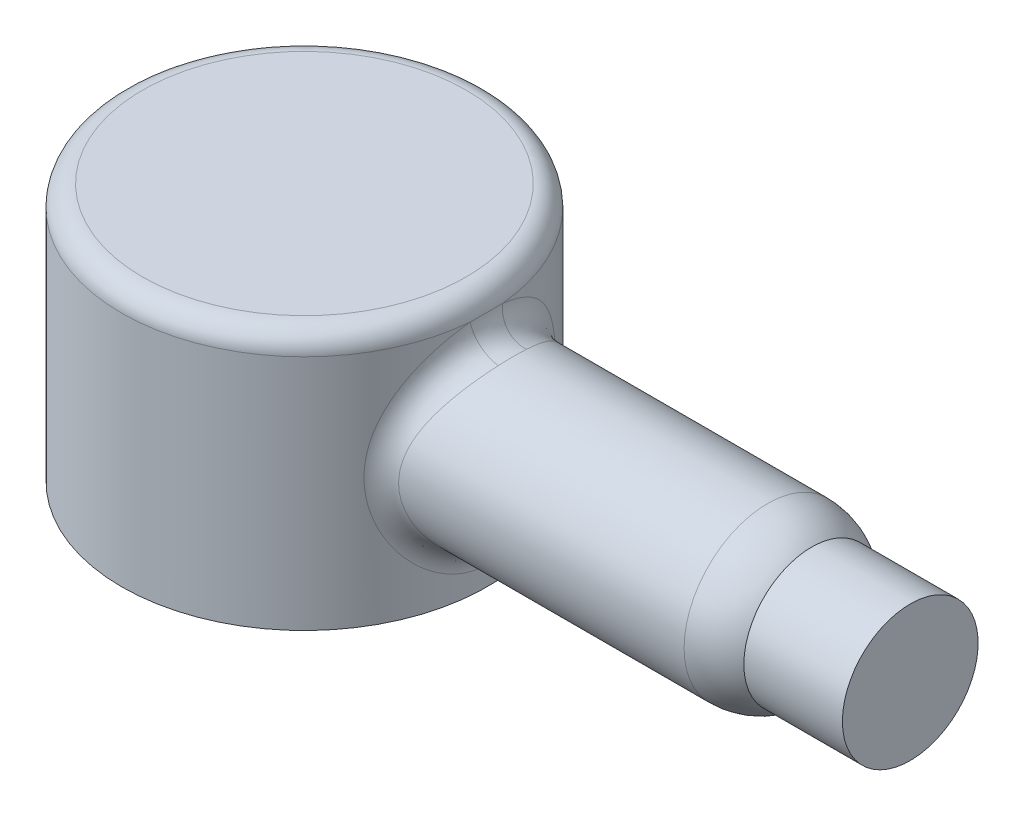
ISO-10303-21;
HEADER;
FILE_DESCRIPTION(('STEP AP214'),'2;1');
FILE_NAME('part.step','',(''),(''),'','','');
FILE_SCHEMA(('AUTOMOTIVE_DESIGN { 1 0 10303 214 1 1 1 1 }'));
ENDSEC;
DATA;
#1=APPLICATION_CONTEXT('core data for automotive mechanical design processes');
#2=APPLICATION_PROTOCOL_DEFINITION('international standard','automotive_design',2000,#1);
#3=PRODUCT_CONTEXT('',#1,'mechanical');
#4=PRODUCT('Part','Part','',(#3));
#5=PRODUCT_RELATED_PRODUCT_CATEGORY('part','',(#4));
#6=PRODUCT_DEFINITION_FORMATION('','',#4);
#7=PRODUCT_DEFINITION_CONTEXT('part definition',#1,'design');
#8=PRODUCT_DEFINITION('design','',#6,#7);
#9=PRODUCT_DEFINITION_SHAPE('','',#8);
#10=(LENGTH_UNIT() NAMED_UNIT(*) SI_UNIT(.MILLI.,.METRE.));
#11=(NAMED_UNIT(*) PLANE_ANGLE_UNIT() SI_UNIT($,.RADIAN.));
#12=(NAMED_UNIT(*) SI_UNIT($,.STERADIAN.) SOLID_ANGLE_UNIT());
#13=UNCERTAINTY_MEASURE_WITH_UNIT(LENGTH_MEASURE(1.E-05),#10,'distance_accuracy_value','');
#14=(GEOMETRIC_REPRESENTATION_CONTEXT(3) GLOBAL_UNCERTAINTY_ASSIGNED_CONTEXT((#13)) GLOBAL_UNIT_ASSIGNED_CONTEXT((#10,
#11,#12)) REPRESENTATION_CONTEXT('',''));
#15=CARTESIAN_POINT('',(0.,0.,0.));
#16=DIRECTION('',(0.,0.,1.));
#17=DIRECTION('',(1.,0.,0.));
#18=AXIS2_PLACEMENT_3D('',#15,#16,#17);
#19=CARTESIAN_POINT('',(0.,22.6281090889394,0.));
#20=DIRECTION('',(0.,1.,0.));
#21=DIRECTION('',(0.,0.,1.));
#22=AXIS2_PLACEMENT_3D('',#19,#20,#21);
#23=CYLINDRICAL_SURFACE('',#22,16.2946277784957);
#24=CARTESIAN_POINT('',(0.,19.05,0.));
#25=DIRECTION('',(0.,1.,0.));
#26=DIRECTION('',(0.,0.,1.));
#27=AXIS2_PLACEMENT_3D('',#24,#25,#26);
#28=CIRCLE('',#27,16.2946277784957);
#29=CARTESIAN_POINT('',(14.0415178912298,19.05,-8.26744638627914));
#30=VERTEX_POINT('',#29);
#31=CARTESIAN_POINT('',(14.0415178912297,19.05,8.26744638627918));
#32=VERTEX_POINT('',#31);
#33=EDGE_CURVE('E119',#30,#32,#28,.T.);
#34=ORIENTED_EDGE('',*,*,#33,.T.);
#35=CARTESIAN_POINT('',(12.73928155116,24.9555,10.16));
#36=CARTESIAN_POINT('',(12.7392857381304,24.7027464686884,10.1599973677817));
#37=CARTESIAN_POINT('',(12.7468364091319,24.4499411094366,10.1505495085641));
#38=CARTESIAN_POINT('',(12.7767031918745,23.9464975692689,10.1129275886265));
#39=CARTESIAN_POINT('',(12.7990281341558,23.6958607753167,10.0847423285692));
#40=CARTESIAN_POINT('',(12.8575030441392,23.1984498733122,10.0100825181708));
#41=CARTESIAN_POINT('',(12.8936812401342,22.9516847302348,9.96357061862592));
#42=CARTESIAN_POINT('',(12.9783759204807,22.4641885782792,9.85299407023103));
#43=CARTESIAN_POINT('',(13.0268985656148,22.2234606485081,9.78892065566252));
#44=CARTESIAN_POINT('',(13.1339785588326,21.7516890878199,9.64476368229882));
#45=CARTESIAN_POINT('',(13.1924396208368,21.5205768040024,9.56483261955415));
#46=CARTESIAN_POINT('',(13.3178365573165,21.06665604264,9.38945013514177));
#47=CARTESIAN_POINT('',(13.3847763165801,20.8438514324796,9.29399159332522));
#48=CARTESIAN_POINT('',(13.5954407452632,20.1892228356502,8.98557951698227));
#49=CARTESIAN_POINT('',(13.7491208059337,19.7707270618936,8.75044780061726));
#50=CARTESIAN_POINT('',(13.9994263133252,19.1471122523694,8.34034284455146));
#51=CARTESIAN_POINT('',(14.0919519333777,18.928047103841,8.18338890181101));
#52=CARTESIAN_POINT('',(14.2787298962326,18.5034332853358,7.85294454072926));
#53=CARTESIAN_POINT('',(14.3729822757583,18.297884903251,7.6794537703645));
#54=CARTESIAN_POINT('',(14.5611012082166,17.900930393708,7.31649204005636));
#55=CARTESIAN_POINT('',(14.6549674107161,17.7095352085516,7.12700895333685));
#56=CARTESIAN_POINT('',(14.8402309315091,17.3418030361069,6.73274762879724));
#57=CARTESIAN_POINT('',(14.9316277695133,17.1654689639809,6.52796644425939));
#58=CARTESIAN_POINT('',(15.1207243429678,16.8085618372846,6.07824124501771));
#59=CARTESIAN_POINT('',(15.2178589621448,16.6300323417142,5.83142963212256));
#60=CARTESIAN_POINT('',(15.4038681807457,16.2947086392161,5.32067351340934));
#61=CARTESIAN_POINT('',(15.4927465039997,16.137904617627,5.05673682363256));
#62=CARTESIAN_POINT('',(15.6597230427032,15.8477172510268,4.51317534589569));
#63=CARTESIAN_POINT('',(15.7378263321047,15.7143228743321,4.23355802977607));
#64=CARTESIAN_POINT('',(15.8809098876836,15.4727004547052,3.66043320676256));
#65=CARTESIAN_POINT('',(15.9458925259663,15.3644678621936,3.36692822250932));
#66=CARTESIAN_POINT('',(16.0548046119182,15.184520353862,2.79877586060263));
#67=CARTESIAN_POINT('',(16.1001995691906,15.1102174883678,2.52522827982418));
#68=CARTESIAN_POINT('',(16.1773965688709,14.9844752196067,1.97103297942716));
#69=CARTESIAN_POINT('',(16.2091994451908,14.9330344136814,1.69038569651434));
#70=CARTESIAN_POINT('',(16.2582397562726,14.8539145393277,1.12474654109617));
#71=CARTESIAN_POINT('',(16.2754898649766,14.8262147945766,0.839758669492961));
#72=CARTESIAN_POINT('',(16.2949343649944,14.7950006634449,0.267961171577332));
#73=CARTESIAN_POINT('',(16.2971304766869,14.7914835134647,-0.0188482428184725));
#74=CARTESIAN_POINT('',(16.2871282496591,14.8075312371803,-0.55308981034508));
#75=CARTESIAN_POINT('',(16.2768167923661,14.8240703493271,-0.80065545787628));
#76=CARTESIAN_POINT('',(16.245103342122,14.8750986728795,-1.29321381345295));
#77=CARTESIAN_POINT('',(16.2237014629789,14.909587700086,-1.53820654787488));
#78=CARTESIAN_POINT('',(16.1702953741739,14.9960666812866,-2.02389208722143));
#79=CARTESIAN_POINT('',(16.1382912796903,15.0480564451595,-2.26458493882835));
#80=CARTESIAN_POINT('',(16.0643840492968,15.1689058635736,-2.74014076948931));
#81=CARTESIAN_POINT('',(16.022480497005,15.2377662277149,-2.97500350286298));
#82=CARTESIAN_POINT('',(15.9295369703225,15.3917856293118,-3.43812037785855));
#83=CARTESIAN_POINT('',(15.8784744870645,15.4769848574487,-3.66635659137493));
#84=CARTESIAN_POINT('',(15.7682816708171,15.6627605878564,-4.11454325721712));
#85=CARTESIAN_POINT('',(15.7091486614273,15.763342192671,-4.33449092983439));
#86=CARTESIAN_POINT('',(15.5839508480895,15.9789787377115,-4.76504207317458));
#87=CARTESIAN_POINT('',(15.5178875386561,16.0940305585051,-4.97564754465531));
#88=CARTESIAN_POINT('',(15.3799695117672,16.3378277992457,-5.38688146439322));
#89=CARTESIAN_POINT('',(15.3081127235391,16.4665781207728,-5.58750630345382));
#90=CARTESIAN_POINT('',(15.1506618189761,16.7537068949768,-6.00228652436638));
#91=CARTESIAN_POINT('',(15.0644682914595,16.9137800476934,-6.21504246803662));
#92=CARTESIAN_POINT('',(14.8880797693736,17.2492690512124,-6.62646999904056));
#93=CARTESIAN_POINT('',(14.7978829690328,17.4246918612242,-6.82513512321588));
#94=CARTESIAN_POINT('',(14.6152683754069,17.7901761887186,-7.20790110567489));
#95=CARTESIAN_POINT('',(14.5228481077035,17.9802545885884,-7.39198465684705));
#96=CARTESIAN_POINT('',(14.3378337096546,18.3741316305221,-7.74474625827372));
#97=CARTESIAN_POINT('',(14.2452395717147,18.5779308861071,-7.91342361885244));
#98=CARTESIAN_POINT('',(14.0500224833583,19.025945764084,-8.25563005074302));
#99=CARTESIAN_POINT('',(13.9476587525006,19.2719729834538,-8.42694440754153));
#100=CARTESIAN_POINT('',(13.748510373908,19.7799015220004,-8.74808960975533));
#101=CARTESIAN_POINT('',(13.6517267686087,20.0418057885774,-8.89791644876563));
#102=CARTESIAN_POINT('',(13.4673595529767,20.5800787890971,-9.17456912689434));
#103=CARTESIAN_POINT('',(13.3797623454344,20.8564252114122,-9.30142916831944));
#104=CARTESIAN_POINT('',(13.2173128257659,21.4225874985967,-9.53086145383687));
#105=CARTESIAN_POINT('',(13.1424551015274,21.7123975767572,-9.63344401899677));
#106=CARTESIAN_POINT('',(13.0266667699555,22.2260451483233,-9.78915876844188));
#107=CARTESIAN_POINT('',(12.981986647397,22.4472598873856,-9.84820457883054));
#108=CARTESIAN_POINT('',(12.902977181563,22.8949137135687,-9.95149807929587));
#109=CARTESIAN_POINT('',(12.8686453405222,23.1213515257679,-9.9957493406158));
#110=CARTESIAN_POINT('',(12.8115521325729,23.577894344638,-10.0688223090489));
#111=CARTESIAN_POINT('',(12.7887778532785,23.8079949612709,-10.0976612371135));
#112=CARTESIAN_POINT('',(12.7555979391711,24.270532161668,-10.1395431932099));
#113=CARTESIAN_POINT('',(12.745192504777,24.5029687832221,-10.1525859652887));
#114=CARTESIAN_POINT('',(12.7371539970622,24.9689347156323,-10.1626692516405));
#115=CARTESIAN_POINT('',(12.7395496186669,25.2024653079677,-10.159673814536));
#116=CARTESIAN_POINT('',(12.757083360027,25.6682822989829,-10.1376482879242));
#117=CARTESIAN_POINT('',(12.7722215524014,25.9005686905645,-10.1186181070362));
#118=CARTESIAN_POINT('',(12.8146628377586,26.3623401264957,-10.0648138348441));
#119=CARTESIAN_POINT('',(12.841974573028,26.5918230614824,-10.0300285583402));
#120=CARTESIAN_POINT('',(12.9077579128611,27.0463132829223,-9.9452275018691));
#121=CARTESIAN_POINT('',(12.9462297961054,27.2713204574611,-9.89521134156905));
#122=CARTESIAN_POINT('',(13.0323504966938,27.7121018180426,-9.78149939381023));
#123=CARTESIAN_POINT('',(13.0798442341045,27.9279658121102,-9.71803293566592));
#124=CARTESIAN_POINT('',(13.1830076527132,28.3532941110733,-9.57761912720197));
#125=CARTESIAN_POINT('',(13.2386801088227,28.5627562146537,-9.50066719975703));
#126=CARTESIAN_POINT('',(13.4157780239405,29.1803419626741,-9.25059599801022));
#127=CARTESIAN_POINT('',(13.5473294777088,29.5778846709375,-9.05820375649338));
#128=CARTESIAN_POINT('',(13.8526445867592,30.4131008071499,-8.58558474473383));
#129=CARTESIAN_POINT('',(14.029680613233,30.8440629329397,-8.2956167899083));
#130=CARTESIAN_POINT('',(14.2992561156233,31.4526057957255,-7.81537707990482));
#131=CARTESIAN_POINT('',(14.3898588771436,31.6492786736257,-7.64759697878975));
#132=CARTESIAN_POINT('',(14.5705978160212,32.0294689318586,-7.297352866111));
#133=CARTESIAN_POINT('',(14.6607339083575,32.2129839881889,-7.1148862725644));
#134=CARTESIAN_POINT('',(14.8528351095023,32.5941284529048,-6.70574789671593));
#135=CARTESIAN_POINT('',(14.9544048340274,32.7893692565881,-6.47665835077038));
#136=CARTESIAN_POINT('',(15.1517170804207,33.1597540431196,-6.00056093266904));
#137=CARTESIAN_POINT('',(15.2474617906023,33.3349055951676,-5.75355986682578));
#138=CARTESIAN_POINT('',(15.4305820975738,33.6636688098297,-5.24267589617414));
#139=CARTESIAN_POINT('',(15.5179582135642,33.8172818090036,-4.97879404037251));
#140=CARTESIAN_POINT('',(15.6818637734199,34.1012642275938,-4.43559312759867));
#141=CARTESIAN_POINT('',(15.758394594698,34.2316365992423,-4.15627603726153));
#142=CARTESIAN_POINT('',(15.8940619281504,34.460227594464,-3.60142281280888));
#143=CARTESIAN_POINT('',(15.9539711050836,34.5599151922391,-3.3266818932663));
#144=CARTESIAN_POINT('',(16.0604590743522,34.7357839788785,-2.76723622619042));
#145=CARTESIAN_POINT('',(16.1070381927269,34.8119657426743,-2.48253172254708));
#146=CARTESIAN_POINT('',(16.1853890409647,34.9394898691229,-1.90594423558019));
#147=CARTESIAN_POINT('',(16.2171775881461,34.9908604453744,-1.6140698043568));
#148=CARTESIAN_POINT('',(16.2649905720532,35.0679451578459,-1.02568953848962));
#149=CARTESIAN_POINT('',(16.2810175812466,35.093663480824,-0.72918446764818));
#150=CARTESIAN_POINT('',(16.2956276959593,35.117106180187,-0.17836659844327));
#151=CARTESIAN_POINT('',(16.2964278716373,35.1183885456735,0.0757443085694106));
#152=CARTESIAN_POINT('',(16.2861674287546,35.1019280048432,0.583088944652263));
#153=CARTESIAN_POINT('',(16.2751082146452,35.0841873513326,0.836322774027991));
#154=CARTESIAN_POINT('',(16.2414003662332,35.0299349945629,1.33996936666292));
#155=CARTESIAN_POINT('',(16.2187522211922,34.9934240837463,1.5903822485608));
#156=CARTESIAN_POINT('',(16.1624071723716,34.9021275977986,2.08658580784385));
#157=CARTESIAN_POINT('',(16.1287100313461,34.8473416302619,2.33237638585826));
#158=CARTESIAN_POINT('',(16.0523560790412,34.7223419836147,2.80947442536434));
#159=CARTESIAN_POINT('',(16.0100408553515,34.6527127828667,3.04099056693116));
#160=CARTESIAN_POINT('',(15.916665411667,34.4977621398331,3.49697583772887));
#161=CARTESIAN_POINT('',(15.8656021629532,34.4124352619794,3.72144249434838));
#162=CARTESIAN_POINT('',(15.7557396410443,34.2269410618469,4.16210494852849));
#163=CARTESIAN_POINT('',(15.6969425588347,34.1267779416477,4.3783030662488));
#164=CARTESIAN_POINT('',(15.5726489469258,33.9123817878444,4.80168739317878));
#165=CARTESIAN_POINT('',(15.507149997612,33.7981436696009,5.00887030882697));
#166=CARTESIAN_POINT('',(15.3635060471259,33.5438727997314,5.43443676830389));
#167=CARTESIAN_POINT('',(15.2847540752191,33.4023934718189,5.65175149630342));
#168=CARTESIAN_POINT('',(15.122024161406,33.1042380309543,6.07375126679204));
#169=CARTESIAN_POINT('',(15.0380439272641,32.9475552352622,6.27843069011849));
#170=CARTESIAN_POINT('',(14.8664472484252,32.6197985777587,6.67459927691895));
#171=CARTESIAN_POINT('',(14.778827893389,32.4487130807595,6.86607754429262));
#172=CARTESIAN_POINT('',(14.6017078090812,32.0930319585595,7.23511742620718));
#173=CARTESIAN_POINT('',(14.5122069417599,31.9084353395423,7.41267801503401));
#174=CARTESIAN_POINT('',(14.3202504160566,31.4990089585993,7.77777086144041));
#175=CARTESIAN_POINT('',(14.2177762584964,31.2722044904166,7.96308576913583));
#176=CARTESIAN_POINT('',(14.0154708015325,30.8026379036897,8.31399438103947));
#177=CARTESIAN_POINT('',(13.9156399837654,30.5598729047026,8.47958451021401));
#178=CARTESIAN_POINT('',(13.7217268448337,30.0593887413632,8.78991266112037));
#179=CARTESIAN_POINT('',(13.6276410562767,29.8016787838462,8.93466333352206));
#180=CARTESIAN_POINT('',(13.4484008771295,29.2720101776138,9.20224740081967));
#181=CARTESIAN_POINT('',(13.3632481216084,29.0000489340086,9.32507678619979));
#182=CARTESIAN_POINT('',(13.222791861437,28.504619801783,9.52281308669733));
#183=CARTESIAN_POINT('',(13.1650455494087,28.283670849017,9.6023158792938));
#184=CARTESIAN_POINT('',(13.0588138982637,27.8348750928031,9.74629578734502));
#185=CARTESIAN_POINT('',(13.0103229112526,27.6070325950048,9.81078207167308));
#186=CARTESIAN_POINT('',(12.9242612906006,27.1460207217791,9.92388083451));
#187=CARTESIAN_POINT('',(12.8866639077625,26.9128659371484,9.97253223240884));
#188=CARTESIAN_POINT('',(12.8236207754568,26.442195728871,10.053471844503));
#189=CARTESIAN_POINT('',(12.7981686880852,26.2046826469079,10.0857685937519));
#190=CARTESIAN_POINT('',(12.7660405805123,25.7983601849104,10.1263783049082));
#191=CARTESIAN_POINT('',(12.7560267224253,25.6302265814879,10.1389740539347));
#192=CARTESIAN_POINT('',(12.7426449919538,25.2932364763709,10.1557868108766));
#193=CARTESIAN_POINT('',(12.7392787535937,25.1243798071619,10.1600017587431));
#194=CARTESIAN_POINT('',(12.73928155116,24.9555,10.16));
#195=B_SPLINE_CURVE_WITH_KNOTS('',3,(#35,#36,#37,#38,#39,#40,#41,#42,#43,#44,#45,#46,#47,#48,
#49,#50,#51,#52,#53,#54,#55,#56,#57,#58,#59,#60,#61,#62,#63,#64,#65,#66,#67,#68,#69,#70,#71,#72,
#73,#74,#75,#76,#77,#78,#79,#80,#81,#82,#83,#84,#85,#86,#87,#88,#89,#90,#91,#92,#93,#94,#95,#96,
#97,#98,#99,#100,#101,#102,#103,#104,#105,#106,#107,#108,#109,#110,#111,#112,#113,#114,#115,
#116,#117,#118,#119,#120,#121,#122,#123,#124,#125,#126,#127,#128,#129,#130,#131,#132,#133,#134,
#135,#136,#137,#138,#139,#140,#141,#142,#143,#144,#145,#146,#147,#148,#149,#150,#151,#152,#153,
#154,#155,#156,#157,#158,#159,#160,#161,#162,#163,#164,#165,#166,#167,#168,#169,#170,#171,#172,
#173,#174,#175,#176,#177,#178,#179,#180,#181,#182,#183,#184,#185,#186,#187,#188,#189,#190,#191,
#192,#193,#194),.UNSPECIFIED.,.T.,.F.,(4,2,2,2,2,2,2,2,2,2,2,2,2,2,2,2,2,2,2,2,2,2,2,2,2,2,2,2,
2,2,2,2,2,2,2,2,2,2,2,2,2,2,2,2,2,2,2,2,2,2,2,2,2,2,2,2,2,2,2,2,2,2,2,2,2,2,2,2,2,2,2,2,2,2,2,2,
2,2,2,4),(0.,0.758065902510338,1.51658530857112,2.2766586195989,3.03711200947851,
3.79057898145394,4.54439243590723,6.05056054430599,6.90473314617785,7.75892393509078,
8.61376836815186,9.46877788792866,10.4266805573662,11.3841490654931,12.341165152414,
13.2980080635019,14.157964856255,15.017868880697,15.8770232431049,16.7360794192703,
17.4801802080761,18.2242733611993,18.968358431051,19.7124748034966,20.4584456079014,
21.2046643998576,21.9507225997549,22.6970486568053,23.5357627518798,24.3748590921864,
25.2149368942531,26.0550522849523,27.0042703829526,27.9536652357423,28.9016343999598,
29.8491998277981,30.5483504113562,31.2473321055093,31.9455311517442,32.6437415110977,
33.343517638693,34.0432977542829,34.7435754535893,35.4438706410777,36.1330688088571,
36.8225013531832,38.2006783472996,39.8405206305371,40.6617553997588,41.4831348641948,
42.4349899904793,43.3864852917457,44.3379215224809,45.2892368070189,46.1829470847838,
47.076635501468,47.969305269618,48.8618293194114,49.6232123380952,50.3845051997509,
51.1457659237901,51.9070429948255,52.6425717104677,53.3783555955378,54.1139314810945,
54.8497738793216,55.6619773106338,56.4745393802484,57.2877642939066,58.1010490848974,
59.0308796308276,59.9608784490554,60.8903103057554,61.8199119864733,62.5446810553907,
63.2690064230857,63.9915378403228,64.7136917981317,65.2200766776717,65.7265860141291),.UNSPECIFIED.);
#196=CARTESIAN_POINT('',(15.64432084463,15.875,4.55742468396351));
#197=VERTEX_POINT('',#196);
#198=EDGE_CURVE('E127',#32,#197,#195,.T.);
#199=ORIENTED_EDGE('',*,*,#198,.T.);
#200=CARTESIAN_POINT('',(0.,15.875,0.));
#201=DIRECTION('',(0.,1.,0.));
#202=DIRECTION('',(0.,0.,1.));
#203=AXIS2_PLACEMENT_3D('',#200,#201,#202);
#204=CIRCLE('',#203,16.2946277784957);
#205=CARTESIAN_POINT('',(15.64432084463,15.875,-4.55742468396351));
#206=VERTEX_POINT('',#205);
#207=EDGE_CURVE('E120',#206,#197,#204,.T.);
#208=ORIENTED_EDGE('',*,*,#207,.F.);
#209=EDGE_CURVE('E121',#206,#30,#195,.T.);
#210=ORIENTED_EDGE('',*,*,#209,.T.);
#211=EDGE_LOOP('',(#34,#199,#208,#210));
#212=FACE_BOUND('',#211,.T.);
#213=ADVANCED_FACE('F34',(#212),#23,.F.);
#214=CARTESIAN_POINT('',(0.,19.05,0.));
#215=DIRECTION('',(0.,-1.,0.));
#216=DIRECTION('',(0.,0.,-1.));
#217=AXIS2_PLACEMENT_3D('',#214,#215,#216);
#218=PLANE('',#217);
#219=DIRECTION('',(0.,0.,1.));
#220=VECTOR('',#219,1.);
#221=CARTESIAN_POINT('',(0.,19.05,0.));
#222=LINE('',#221,#220);
#223=CARTESIAN_POINT('',(0.,19.05,-8.26744638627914));
#224=VERTEX_POINT('',#223);
#225=CARTESIAN_POINT('',(0.,19.05,8.26744638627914));
#226=VERTEX_POINT('',#225);
#227=EDGE_CURVE('E98',#224,#226,#222,.T.);
#228=ORIENTED_EDGE('',*,*,#227,.T.);
#229=DIRECTION('',(-1.,0.,0.));
#230=VECTOR('',#229,1.);
#231=CARTESIAN_POINT('',(-32.0518608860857,19.05,8.26744638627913));
#232=LINE('',#231,#230);
#233=EDGE_CURVE('E112',#226,#32,#232,.F.);
#234=ORIENTED_EDGE('',*,*,#233,.T.);
#235=ORIENTED_EDGE('',*,*,#33,.F.);
#236=DIRECTION('',(-1.,0.,0.));
#237=VECTOR('',#236,1.);
#238=CARTESIAN_POINT('',(-32.0518608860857,19.05,-8.26744638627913));
#239=LINE('',#238,#237);
#240=EDGE_CURVE('E110',#30,#224,#239,.T.);
#241=ORIENTED_EDGE('',*,*,#240,.T.);
#242=EDGE_LOOP('',(#228,#234,#235,#241));
#243=FACE_BOUND('',#242,.T.);
#244=ADVANCED_FACE('F117',(#243),#218,.T.);
#245=CARTESIAN_POINT('',(0.,22.6281090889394,0.));
#246=DIRECTION('',(0.,1.,0.));
#247=DIRECTION('',(0.,0.,1.));
#248=AXIS2_PLACEMENT_3D('',#245,#246,#247);
#249=CYLINDRICAL_SURFACE('',#248,22.225);
#250=CARTESIAN_POINT('',(0.,38.1,0.));
#251=DIRECTION('',(0.,1.,0.));
#252=DIRECTION('',(0.,0.,1.));
#253=AXIS2_PLACEMENT_3D('',#250,#251,#252);
#254=CIRCLE('',#253,22.225);
#255=CARTESIAN_POINT('',(22.1379436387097,38.1,-1.96521664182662));
#256=VERTEX_POINT('',#255);
#257=CARTESIAN_POINT('',(22.1379436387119,38.1,1.96521664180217));
#258=VERTEX_POINT('',#257);
#259=EDGE_CURVE('E148',#256,#258,#254,.T.);
#260=ORIENTED_EDGE('',*,*,#259,.F.);
#261=CARTESIAN_POINT('',(18.9397488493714,23.8661212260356,11.6291245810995));
#262=CARTESIAN_POINT('',(19.8671262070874,24.0365954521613,10.1187534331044));
#263=CARTESIAN_POINT('',(21.6454272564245,24.1254971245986,10.1260404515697));
#264=CARTESIAN_POINT('',(18.924644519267,24.2090579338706,11.6537223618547));
#265=CARTESIAN_POINT('',(19.8538698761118,24.3254082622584,10.1447379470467));
#266=CARTESIAN_POINT('',(21.6281651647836,24.3867822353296,10.1474589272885));
#267=CARTESIAN_POINT('',(18.9166153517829,24.5534656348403,11.666716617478));
#268=CARTESIAN_POINT('',(19.846793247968,24.6162250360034,10.1585102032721));
#269=CARTESIAN_POINT('',(21.6189889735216,24.6491881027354,10.1587736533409));
#270=CARTESIAN_POINT('',(18.9150126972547,25.2424235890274,11.6693160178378));
#271=CARTESIAN_POINT('',(19.8453839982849,25.1976140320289,10.1612596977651));
#272=CARTESIAN_POINT('',(21.6171573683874,25.1741084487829,10.1610370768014));
#273=CARTESIAN_POINT('',(18.921437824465,25.5869738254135,11.6589234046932));
#274=CARTESIAN_POINT('',(19.851048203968,25.4885878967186,10.1502431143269));
#275=CARTESIAN_POINT('',(21.6245003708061,25.4366229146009,10.1519877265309));
#276=CARTESIAN_POINT('',(18.948489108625,26.27340346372,11.6149059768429));
#277=CARTESIAN_POINT('',(19.874812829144,26.0672516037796,10.1037047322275));
#278=CARTESIAN_POINT('',(21.655416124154,25.959616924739,10.1136596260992));
#279=CARTESIAN_POINT('',(18.9691161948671,26.6152826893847,11.581279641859));
#280=CARTESIAN_POINT('',(19.8929464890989,26.3553328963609,10.0681176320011));
#281=CARTESIAN_POINT('',(21.6789899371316,26.220096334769,10.0843795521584));
#282=CARTESIAN_POINT('',(19.02377014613,27.2936721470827,11.4912817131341));
#283=CARTESIAN_POINT('',(19.940758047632,26.9253167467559,9.97320287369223));
#284=CARTESIAN_POINT('',(21.7414515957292,26.7369644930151,10.006014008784));
#285=CARTESIAN_POINT('',(19.0577971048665,27.6301823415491,11.4349099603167));
#286=CARTESIAN_POINT('',(19.9704982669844,27.2075796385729,9.91374930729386));
#287=CARTESIAN_POINT('',(21.7803395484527,26.9933532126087,9.95692840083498));
#288=CARTESIAN_POINT('',(19.1354373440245,28.2741808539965,11.3044693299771));
#289=CARTESIAN_POINT('',(20.037919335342,27.745523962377,9.77678929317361));
#290=CARTESIAN_POINT('',(21.8690712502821,27.4840187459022,9.84334744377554));
#291=CARTESIAN_POINT('',(19.1782992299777,28.5821497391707,11.2317612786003));
#292=CARTESIAN_POINT('',(20.0750502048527,28.0020795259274,9.7005125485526));
#293=CARTESIAN_POINT('',(21.9180562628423,27.718661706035,9.78003703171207));
#294=CARTESIAN_POINT('',(19.2733832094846,29.1896761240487,11.0678041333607));
#295=CARTESIAN_POINT('',(20.156844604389,28.5058143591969,9.52931757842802));
#296=CARTESIAN_POINT('',(22.0267236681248,28.1815389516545,9.63727162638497));
#297=CARTESIAN_POINT('',(19.3256084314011,29.489230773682,10.9765488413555));
#298=CARTESIAN_POINT('',(20.2015879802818,28.7531994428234,9.43421749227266));
#299=CARTESIAN_POINT('',(22.086409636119,28.4097710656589,9.5578112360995));
#300=CARTESIAN_POINT('',(19.4941846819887,30.3729746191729,10.6761515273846));
#301=CARTESIAN_POINT('',(20.3452105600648,29.4808373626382,9.1219638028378));
#302=CARTESIAN_POINT('',(22.2790682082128,29.0830997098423,9.29624078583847));
#303=CARTESIAN_POINT('',(19.622485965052,30.9426312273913,10.440298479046));
#304=CARTESIAN_POINT('',(20.4531847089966,29.9436607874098,8.87835580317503));
#305=CARTESIAN_POINT('',(22.4256982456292,29.5171237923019,9.09087214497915));
#306=CARTESIAN_POINT('',(19.914262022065,32.0955838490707,9.87347002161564));
#307=CARTESIAN_POINT('',(20.6929054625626,30.8659028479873,8.30226882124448));
#308=CARTESIAN_POINT('',(22.7591565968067,30.395563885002,8.59730722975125));
#309=CARTESIAN_POINT('',(20.0800777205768,32.6730597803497,9.5347258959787));
#310=CARTESIAN_POINT('',(20.8263680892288,31.3186047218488,7.96120936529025));
#311=CARTESIAN_POINT('',(22.9486602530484,30.8355455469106,8.30234635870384));
#312=CARTESIAN_POINT('',(20.4195328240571,33.7598966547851,8.78422727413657));
#313=CARTESIAN_POINT('',(21.0901182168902,32.1504527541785,7.22376387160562));
#314=CARTESIAN_POINT('',(23.3366089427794,31.66361173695,7.64885096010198));
#315=CARTESIAN_POINT('',(20.593177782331,34.2692081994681,8.37242032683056));
#316=CARTESIAN_POINT('',(21.2206104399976,32.5288975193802,6.82544431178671));
#317=CARTESIAN_POINT('',(23.5350603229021,32.0516586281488,7.29027076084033));
#318=CARTESIAN_POINT('',(20.8575584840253,35.0019822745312,7.68007873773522));
#319=CARTESIAN_POINT('',(21.4101640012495,33.0549367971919,6.17824268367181));
#320=CARTESIAN_POINT('',(23.837209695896,32.6099626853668,6.68741549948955));
#321=CARTESIAN_POINT('',(20.9510259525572,35.2523118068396,7.42194158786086));
#322=CARTESIAN_POINT('',(21.4757407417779,33.2316662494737,5.93912226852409));
#323=CARTESIAN_POINT('',(23.9440296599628,32.8006899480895,6.4626430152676));
#324=CARTESIAN_POINT('',(21.1330511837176,35.7272096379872,6.88655070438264));
#325=CARTESIAN_POINT('',(21.6001081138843,33.5604449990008,5.45162454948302));
#326=CARTESIAN_POINT('',(24.1520584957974,33.162516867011,5.996452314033));
#327=CARTESIAN_POINT('',(21.2216107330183,35.9517873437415,6.6093040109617));
#328=CARTESIAN_POINT('',(21.6588000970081,33.7121518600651,5.20319957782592));
#329=CARTESIAN_POINT('',(24.2532694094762,33.3336236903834,5.75504022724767));
#330=CARTESIAN_POINT('',(21.3914475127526,36.3735170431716,6.03703012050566));
#331=CARTESIAN_POINT('',(21.7681197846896,33.9909998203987,4.69993278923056));
#332=CARTESIAN_POINT('',(24.4473685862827,33.6549415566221,5.25673371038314));
#333=CARTESIAN_POINT('',(21.4727223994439,36.5706602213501,5.74199725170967));
#334=CARTESIAN_POINT('',(21.8186084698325,34.1177361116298,4.44518389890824));
#335=CARTESIAN_POINT('',(24.5402541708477,33.8051458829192,4.9998343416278));
#336=CARTESIAN_POINT('',(21.6256485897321,36.9355007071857,5.1360962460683));
#337=CARTESIAN_POINT('',(21.910736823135,34.3470928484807,3.93218220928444));
#338=CARTESIAN_POINT('',(24.715026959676,34.0831195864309,4.47224707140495));
#339=CARTESIAN_POINT('',(21.6973049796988,37.1032135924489,4.82523659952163));
#340=CARTESIAN_POINT('',(21.9522281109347,34.4493209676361,3.67417550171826));
#341=CARTESIAN_POINT('',(24.7969199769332,34.2109008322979,4.20156656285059));
#342=CARTESIAN_POINT('',(21.8266892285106,37.4022248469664,4.2005349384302));
#343=CARTESIAN_POINT('',(22.0248853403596,34.6275980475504,3.16576970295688));
#344=CARTESIAN_POINT('',(24.9447876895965,34.4387189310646,3.65760865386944));
#345=CARTESIAN_POINT('',(21.884810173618,37.5345739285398,3.88715997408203));
#346=CARTESIAN_POINT('',(22.0562292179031,34.7041040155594,2.91568854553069));
#347=CARTESIAN_POINT('',(25.0112116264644,34.5395563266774,3.38473793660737));
#348=CARTESIAN_POINT('',(21.98850242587,37.7685829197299,3.24971199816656));
#349=CARTESIAN_POINT('',(22.1106683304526,34.8368289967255,2.41570382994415));
#350=CARTESIAN_POINT('',(25.1297170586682,34.7178488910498,2.82968119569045));
#351=CARTESIAN_POINT('',(22.034073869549,37.8702431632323,2.92563910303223));
#352=CARTESIAN_POINT('',(22.1336431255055,34.8927528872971,2.16627031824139));
#353=CARTESIAN_POINT('',(25.1817987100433,34.7953043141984,2.54749527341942));
#354=CARTESIAN_POINT('',(22.1112665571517,38.0414261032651,2.26968751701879));
#355=CARTESIAN_POINT('',(22.171758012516,34.9855788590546,1.6684434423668));
#356=CARTESIAN_POINT('',(25.2700189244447,34.9257294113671,1.97632654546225));
#357=CARTESIAN_POINT('',(22.1428988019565,38.1109741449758,1.93781520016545));
#358=CARTESIAN_POINT('',(22.1868116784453,35.0222707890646,1.42060750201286));
#359=CARTESIAN_POINT('',(25.3061700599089,34.978718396,1.68734928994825));
#360=CARTESIAN_POINT('',(22.1912743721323,38.2170142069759,1.26898834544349));
#361=CARTESIAN_POINT('',(22.209580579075,35.0778156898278,0.925646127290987));
#362=CARTESIAN_POINT('',(25.36145642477,35.0595108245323,1.10496944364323));
#363=CARTESIAN_POINT('',(22.2080193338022,38.2535098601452,0.932034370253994));
#364=CARTESIAN_POINT('',(22.2172381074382,35.0965281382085,0.679140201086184));
#365=CARTESIAN_POINT('',(25.3805935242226,35.0873170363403,0.811567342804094));
#366=CARTESIAN_POINT('',(22.2251072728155,38.2907407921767,0.293163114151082));
#367=CARTESIAN_POINT('',(22.2250587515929,35.1156418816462,0.213061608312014));
#368=CARTESIAN_POINT('',(25.4001225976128,35.1156834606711,0.255271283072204));
#369=CARTESIAN_POINT('',(22.2270418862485,38.2949463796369,-0.00856146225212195));
#370=CARTESIAN_POINT('',(22.2259328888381,35.1177803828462,-0.00605949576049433));
#371=CARTESIAN_POINT('',(25.4023335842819,35.1188877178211,-0.00745487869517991));
#372=CARTESIAN_POINT('',(22.2186370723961,38.276646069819,-0.611214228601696));
#373=CARTESIAN_POINT('',(22.2220978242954,35.1084051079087,-0.445006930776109));
#374=CARTESIAN_POINT('',(25.3927280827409,35.1049446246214,-0.532213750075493));
#375=CARTESIAN_POINT('',(22.2082981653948,38.2541413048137,-0.912142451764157));
#376=CARTESIAN_POINT('',(22.2173969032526,35.0969115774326,-0.664371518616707));
#377=CARTESIAN_POINT('',(25.3809121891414,35.0877981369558,-0.794246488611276));
#378=CARTESIAN_POINT('',(22.1756115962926,38.1827061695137,-1.51088339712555));
#379=CARTESIAN_POINT('',(22.20221928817,35.0598547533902,-1.10437456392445));
#380=CARTESIAN_POINT('',(25.3435561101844,35.0333713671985,-1.31559914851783));
#381=CARTESIAN_POINT('',(22.1532653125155,38.1337788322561,-1.80869647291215));
#382=CARTESIAN_POINT('',(22.1917746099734,35.0343695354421,-1.32456449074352));
#383=CARTESIAN_POINT('',(25.3180175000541,34.9960933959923,-1.57491937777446));
#384=CARTESIAN_POINT('',(22.097124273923,38.0100883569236,-2.39909646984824));
#385=CARTESIAN_POINT('',(22.1647685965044,34.9685537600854,-1.76651380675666));
#386=CARTESIAN_POINT('',(25.2538563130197,34.9018530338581,-2.08900917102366));
#387=CARTESIAN_POINT('',(22.0633288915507,37.9353238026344,-2.69168310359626));
#388=CARTESIAN_POINT('',(22.1482607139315,34.9283531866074,-1.98785472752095));
#389=CARTESIAN_POINT('',(25.2152330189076,34.8448895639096,-2.34377848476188));
#390=CARTESIAN_POINT('',(21.9861980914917,37.7632263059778,-3.26161320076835));
#391=CARTESIAN_POINT('',(22.1092942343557,34.8334577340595,-2.42572860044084));
#392=CARTESIAN_POINT('',(25.1270835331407,34.7137676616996,-2.84004414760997));
#393=CARTESIAN_POINT('',(21.9431528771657,37.6665759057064,-3.53915440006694));
#394=CARTESIAN_POINT('',(22.0870852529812,34.7793708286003,-2.64184020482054));
#395=CARTESIAN_POINT('',(25.0778890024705,34.6401292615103,-3.08171267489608));
#396=CARTESIAN_POINT('',(21.8479848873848,37.4506251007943,-4.08572286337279));
#397=CARTESIAN_POINT('',(22.0362681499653,34.6553459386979,-3.07452292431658));
#398=CARTESIAN_POINT('',(24.9691255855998,34.475595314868,-3.55763623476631));
#399=CARTESIAN_POINT('',(21.7958639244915,37.3313292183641,-4.35475181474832));
#400=CARTESIAN_POINT('',(22.0077428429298,34.5856118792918,-3.29080736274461));
#401=CARTESIAN_POINT('',(24.9095587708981,34.3847032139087,-3.79189273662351));
#402=CARTESIAN_POINT('',(21.6836467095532,37.0711262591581,-4.88292403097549));
#403=CARTESIAN_POINT('',(21.9441886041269,34.429478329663,-3.72272066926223));
#404=CARTESIAN_POINT('',(24.7813105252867,34.1864533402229,-4.25179779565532));
#405=CARTESIAN_POINT('',(21.6235513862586,36.9302216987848,-5.14206844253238));
#406=CARTESIAN_POINT('',(21.9092497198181,34.3433060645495,-3.93812912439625));
#407=CARTESIAN_POINT('',(24.712630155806,34.0790974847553,-4.47744735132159));
#408=CARTESIAN_POINT('',(21.4965843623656,36.6278202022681,-5.64942789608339));
#409=CARTESIAN_POINT('',(21.8330219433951,34.15368821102,-4.36687761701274));
#410=CARTESIAN_POINT('',(24.5675249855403,33.8486963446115,-4.91922973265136));
#411=CARTESIAN_POINT('',(21.4297077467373,36.4663083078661,-5.8976348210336));
#412=CARTESIAN_POINT('',(21.7918174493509,34.0504653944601,-4.58007104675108));
#413=CARTESIAN_POINT('',(24.4910945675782,33.7256396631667,-5.13535549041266));
#414=CARTESIAN_POINT('',(21.2095669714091,35.9247240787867,-6.66340335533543));
#415=CARTESIAN_POINT('',(21.6527771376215,33.6980483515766,-5.24451305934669));
#416=CARTESIAN_POINT('',(24.2395051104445,33.3130040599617,-5.80214713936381));
#417=CARTESIAN_POINT('',(21.0461749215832,35.5086620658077,-7.15901704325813));
#418=CARTESIAN_POINT('',(21.5436160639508,33.4158639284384,-5.69248098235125));
#419=CARTESIAN_POINT('',(24.0527713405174,32.9960044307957,-6.2337019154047));
#420=CARTESIAN_POINT('',(20.7080887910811,34.5955791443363,-8.08512814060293));
#421=CARTESIAN_POINT('',(21.305028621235,32.7676411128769,-6.55182656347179));
#422=CARTESIAN_POINT('',(23.6663871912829,32.3003222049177,-7.04011157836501));
#423=CARTESIAN_POINT('',(20.5333889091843,34.0985164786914,-8.51559174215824));
#424=CARTESIAN_POINT('',(21.1760479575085,32.4034257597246,-6.9639282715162));
#425=CARTESIAN_POINT('',(23.4667301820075,31.9216077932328,-7.41493702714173));
#426=CARTESIAN_POINT('',(20.2659674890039,33.2725413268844,-9.12674602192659));
#427=CARTESIAN_POINT('',(20.9703639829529,31.7756210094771,-7.56201227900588));
#428=CARTESIAN_POINT('',(23.1611057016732,31.2922933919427,-7.94709857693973));
#429=CARTESIAN_POINT('',(20.1716641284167,32.9683629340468,-9.33279046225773));
#430=CARTESIAN_POINT('',(20.896699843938,31.5421205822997,-7.76532646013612));
#431=CARTESIAN_POINT('',(23.053330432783,31.0605384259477,-8.12651142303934));
#432=CARTESIAN_POINT('',(19.9871919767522,32.3399297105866,-9.72157324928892));
#433=CARTESIAN_POINT('',(20.7503412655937,31.0532156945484,-8.15213355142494));
#434=CARTESIAN_POINT('',(22.8425051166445,30.5817321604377,-8.46504337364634));
#435=CARTESIAN_POINT('',(19.8970194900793,32.0156934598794,-9.90433269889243));
#436=CARTESIAN_POINT('',(20.6775808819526,30.7978766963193,-8.33599688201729));
#437=CARTESIAN_POINT('',(22.7394508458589,30.3346950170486,-8.62418085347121));
#438=CARTESIAN_POINT('',(19.7235196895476,31.3483026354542,-10.2454905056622));
#439=CARTESIAN_POINT('',(20.5358592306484,30.2666120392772,-8.68139200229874));
#440=CARTESIAN_POINT('',(22.5411653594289,29.8262067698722,-8.92124343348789));
#441=CARTESIAN_POINT('',(19.6401969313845,31.0051357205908,-10.4038727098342));
#442=CARTESIAN_POINT('',(20.4667919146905,29.9905949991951,-8.84329716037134));
#443=CARTESIAN_POINT('',(22.4459393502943,29.5647462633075,-9.0591544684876));
#444=CARTESIAN_POINT('',(19.4833502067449,30.3018180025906,-10.6947186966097));
#445=CARTESIAN_POINT('',(20.3355920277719,29.4201566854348,-9.14196377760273));
#446=CARTESIAN_POINT('',(22.2666859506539,29.0288851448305,-9.31240811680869));
#447=CARTESIAN_POINT('',(19.4098277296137,29.9416646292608,-10.8271785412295));
#448=CARTESIAN_POINT('',(20.2733227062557,29.1255323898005,-9.27911199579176));
#449=CARTESIAN_POINT('',(22.1826602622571,28.7544825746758,-9.42774730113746));
#450=CARTESIAN_POINT('',(19.27710005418,29.2156433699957,-11.0617256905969));
#451=CARTESIAN_POINT('',(20.1601907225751,28.5278783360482,-9.5226908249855));
#452=CARTESIAN_POINT('',(22.030971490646,28.2013235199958,-9.63197883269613));
#453=CARTESIAN_POINT('',(19.2175897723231,28.8501282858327,-11.1644741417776));
#454=CARTESIAN_POINT('',(20.1089552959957,28.2249716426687,-9.63011167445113));
#455=CARTESIAN_POINT('',(21.9629597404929,27.9228358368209,-9.72144687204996));
#456=CARTESIAN_POINT('',(19.1131079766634,28.1078120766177,-11.3424161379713));
#457=CARTESIAN_POINT('',(20.0186650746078,27.6072510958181,-9.81641812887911));
#458=CARTESIAN_POINT('',(21.8435519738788,27.3572615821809,-9.87638956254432));
#459=CARTESIAN_POINT('',(19.0681338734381,27.7310129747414,-11.4176145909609));
#460=CARTESIAN_POINT('',(19.9794768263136,27.2920327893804,-9.89559726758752));
#461=CARTESIAN_POINT('',(21.7921529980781,27.0701765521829,-9.94186848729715));
#462=CARTESIAN_POINT('',(18.9948548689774,26.9703415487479,-11.5391140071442));
#463=CARTESIAN_POINT('',(19.9155297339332,26.6541505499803,-10.0235482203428));
#464=CARTESIAN_POINT('',(21.7084055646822,26.4906173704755,-10.0476638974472));
#465=CARTESIAN_POINT('',(18.9665050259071,26.5864912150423,-11.585492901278));
#466=CARTESIAN_POINT('',(19.8906292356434,26.3310195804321,-10.0726130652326));
#467=CARTESIAN_POINT('',(21.6760057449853,26.1981599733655,-10.088048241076));
#468=CARTESIAN_POINT('',(18.9276822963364,25.8146518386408,-11.6488150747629));
#469=CARTESIAN_POINT('',(19.856552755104,25.6807786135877,-10.1395273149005));
#470=CARTESIAN_POINT('',(21.6316369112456,25.6100918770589,-10.1431859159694));
#471=CARTESIAN_POINT('',(18.9171975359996,25.4266657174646,-11.6657779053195));
#472=CARTESIAN_POINT('',(19.8473077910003,25.3531201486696,-10.1575130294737));
#473=CARTESIAN_POINT('',(21.6196543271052,25.3144834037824,-10.1579562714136));
#474=CARTESIAN_POINT('',(18.9149719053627,24.7677610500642,-11.6693783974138));
#475=CARTESIAN_POINT('',(19.8453463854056,24.7970847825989,-10.161328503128));
#476=CARTESIAN_POINT('',(21.6171107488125,24.8124608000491,-10.1610913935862));
#477=CARTESIAN_POINT('',(18.9185265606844,24.4968746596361,-11.6636272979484));
#478=CARTESIAN_POINT('',(19.84847890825,24.5683789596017,-10.155234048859));
#479=CARTESIAN_POINT('',(21.6211732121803,24.6060711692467,-10.1560836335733));
#480=CARTESIAN_POINT('',(18.9344643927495,23.9563716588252,-11.6377369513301));
#481=CARTESIAN_POINT('',(19.8624890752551,24.1125238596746,-10.1278507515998));
#482=CARTESIAN_POINT('',(21.6393878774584,24.1942593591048,-10.1335396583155));
#483=CARTESIAN_POINT('',(18.9468465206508,23.6867549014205,-11.6175994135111));
#484=CARTESIAN_POINT('',(19.8733776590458,23.8851822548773,-10.1065404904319));
#485=CARTESIAN_POINT('',(21.6535388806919,23.9888370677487,-10.1160049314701));
#486=CARTESIAN_POINT('',(18.9856934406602,23.0608490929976,-11.5540437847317));
#487=CARTESIAN_POINT('',(19.9074495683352,23.3582120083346,-10.0394008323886));
#488=CARTESIAN_POINT('',(21.6979353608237,23.511956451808,-10.0606639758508));
#489=CARTESIAN_POINT('',(19.0154712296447,22.705540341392,-11.5051121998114));
#490=CARTESIAN_POINT('',(19.9335554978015,23.0594822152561,-9.98769815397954));
#491=CARTESIAN_POINT('',(21.7319671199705,23.2412450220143,-10.0180568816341));
#492=CARTESIAN_POINT('',(19.0889892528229,22.0022615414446,-11.3827140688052));
#493=CARTESIAN_POINT('',(19.9976161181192,22.4704137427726,-9.85891527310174));
#494=CARTESIAN_POINT('',(21.8159877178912,22.7054135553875,-9.91147891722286));
#495=CARTESIAN_POINT('',(19.1327375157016,21.6542958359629,-11.3092334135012));
#496=CARTESIAN_POINT('',(20.0356653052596,22.1796970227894,-9.78163858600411));
#497=CARTESIAN_POINT('',(21.865985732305,22.4402968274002,-9.84749576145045));
#498=CARTESIAN_POINT('',(19.2326119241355,20.9676313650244,-11.138538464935));
#499=CARTESIAN_POINT('',(20.1218610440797,21.6088764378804,-9.60305697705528));
#500=CARTESIAN_POINT('',(21.9801279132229,21.9171238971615,-9.69886342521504));
#501=CARTESIAN_POINT('',(19.2887638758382,20.6289535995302,-11.0412746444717));
#502=CARTESIAN_POINT('',(20.1701348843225,21.3284815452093,-9.50146619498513));
#503=CARTESIAN_POINT('',(22.0443015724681,21.6590836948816,-9.61417111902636));
#504=CARTESIAN_POINT('',(19.4114071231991,19.9636389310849,-10.8242064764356));
#505=CARTESIAN_POINT('',(20.2746059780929,20.7810868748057,-9.27613774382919));
#506=CARTESIAN_POINT('',(22.1844652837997,21.1521772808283,-9.42515938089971));
#507=CARTESIAN_POINT('',(19.4779032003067,19.6370076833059,-10.7043916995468));
#508=CARTESIAN_POINT('',(20.3309182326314,20.5138565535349,-9.15211777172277));
#509=CARTESIAN_POINT('',(22.2604608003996,20.9033153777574,-9.32083086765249));
#510=CARTESIAN_POINT('',(19.6887304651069,18.6823548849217,-10.3146137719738));
#511=CARTESIAN_POINT('',(20.5081013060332,19.7360859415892,-8.75010147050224));
#512=CARTESIAN_POINT('',(22.5014062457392,20.1759608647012,-8.98143240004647));
#513=CARTESIAN_POINT('',(19.8452272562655,18.0742784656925,-10.0129788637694));
#514=CARTESIAN_POINT('',(20.6372788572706,19.249824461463,-8.44189499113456));
#515=CARTESIAN_POINT('',(22.6802597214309,19.71266454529,-8.71878431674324));
#516=CARTESIAN_POINT('',(20.1735434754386,16.9234178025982,-9.33386814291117));
#517=CARTESIAN_POINT('',(20.899852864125,18.348741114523,-7.76297272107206));
#518=CARTESIAN_POINT('',(23.0554782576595,18.8358183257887,-8.12744981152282));
#519=CARTESIAN_POINT('',(20.3453608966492,16.3806250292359,-8.95640225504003));
#520=CARTESIAN_POINT('',(21.0336964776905,17.9340039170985,-7.39012827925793));
#521=CARTESIAN_POINT('',(23.2518410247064,18.4222619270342,-7.79877203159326));
#522=CARTESIAN_POINT('',(20.7052304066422,15.31871583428,-8.0921505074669));
#523=CARTESIAN_POINT('',(21.303453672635,17.1435777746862,-6.55852978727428));
#524=CARTESIAN_POINT('',(23.6631204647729,17.6131882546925,-7.0462262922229));
#525=CARTESIAN_POINT('',(20.8932463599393,14.8069598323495,-7.59832437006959));
#526=CARTESIAN_POINT('',(21.4379221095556,16.7779313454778,-6.09399207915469));
#527=CARTESIAN_POINT('',(23.8779958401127,17.2232789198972,-6.61622802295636));
#528=CARTESIAN_POINT('',(21.160097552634,14.114793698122,-6.80291835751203));
#529=CARTESIAN_POINT('',(21.6181871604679,16.3036423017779,-5.37645664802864));
#530=CARTESIAN_POINT('',(24.1829686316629,16.6959142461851,-5.92362959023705));
#531=CARTESIAN_POINT('',(21.2465718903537,13.8965289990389,-6.52847006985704));
#532=CARTESIAN_POINT('',(21.6751241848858,16.156918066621,-5.1314414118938));
#533=CARTESIAN_POINT('',(24.2817964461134,16.5296173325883,-5.68465421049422));
#534=CARTESIAN_POINT('',(21.4122416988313,13.4867754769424,-5.96265171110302));
#535=CARTESIAN_POINT('',(21.7811277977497,15.8872131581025,-4.63553101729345));
#536=CARTESIAN_POINT('',(24.4711333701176,16.2174241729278,-5.19196883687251));
#537=CARTESIAN_POINT('',(21.4914405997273,13.2952740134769,-5.67128972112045));
#538=CARTESIAN_POINT('',(21.8300677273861,15.7645975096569,-4.3847373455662));
#539=CARTESIAN_POINT('',(24.5616463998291,16.0715182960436,-4.93826587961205));
#540=CARTESIAN_POINT('',(21.6406913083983,12.9401260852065,-5.07215938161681));
#541=CARTESIAN_POINT('',(21.9195384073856,15.5421702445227,-3.87889571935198));
#542=CARTESIAN_POINT('',(24.7322186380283,15.8009293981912,-4.41657415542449));
#543=CARTESIAN_POINT('',(21.7107080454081,12.7765857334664,-4.76433410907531));
#544=CARTESIAN_POINT('',(21.9598874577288,15.4428390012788,-3.62409308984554));
#545=CARTESIAN_POINT('',(24.8122377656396,15.6763272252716,-4.14853582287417));
#546=CARTESIAN_POINT('',(21.8392227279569,12.4800814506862,-4.13544283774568));
#547=CARTESIAN_POINT('',(22.0317585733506,15.2665934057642,-3.11340921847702));
#548=CARTESIAN_POINT('',(24.9591116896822,15.4504192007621,-3.60092981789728));
#549=CARTESIAN_POINT('',(21.8977264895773,12.34710207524,-3.81438362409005));
#550=CARTESIAN_POINT('',(22.0631399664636,15.1900314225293,-2.85791462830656));
#551=CARTESIAN_POINT('',(25.0259731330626,15.3491015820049,-3.32136805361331));
#552=CARTESIAN_POINT('',(22.0014705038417,12.113376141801,-3.16150365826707));
#553=CARTESIAN_POINT('',(22.1173085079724,15.0580018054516,-2.34734797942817));
#554=CARTESIAN_POINT('',(25.1445377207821,15.1710246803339,-2.75287393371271));
#555=CARTESIAN_POINT('',(22.0467182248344,12.0126114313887,-2.82968908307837));
#556=CARTESIAN_POINT('',(22.1399743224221,15.0028310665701,-2.09278451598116));
#557=CARTESIAN_POINT('',(25.1962494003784,15.0942515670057,-2.46394695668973));
#558=CARTESIAN_POINT('',(22.1225655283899,11.8446621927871,-2.15798299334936));
#559=CARTESIAN_POINT('',(22.1772092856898,14.9121396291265,-1.58456921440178));
#560=CARTESIAN_POINT('',(25.282932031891,14.966290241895,-1.87906002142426));
#561=CARTESIAN_POINT('',(22.1531670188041,11.7774732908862,-1.8180925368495));
#562=CARTESIAN_POINT('',(22.1916842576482,14.8768478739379,-1.33152191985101));
#563=CARTESIAN_POINT('',(25.3179051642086,14.9150986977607,-1.58310098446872));
#564=CARTESIAN_POINT('',(22.1962797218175,11.6830737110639,-1.17028902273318));
#565=CARTESIAN_POINT('',(22.2118717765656,14.8275867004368,-0.853398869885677));
#566=CARTESIAN_POINT('',(25.3671768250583,14.8431752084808,-1.01902717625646));
#567=CARTESIAN_POINT('',(22.2103833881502,11.6523387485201,-0.862871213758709));
#568=CARTESIAN_POINT('',(22.2183196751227,14.811828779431,-0.628657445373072));
#569=CARTESIAN_POINT('',(25.3832953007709,14.8197580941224,-0.751343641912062));
#570=CARTESIAN_POINT('',(22.225769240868,11.6188175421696,-0.246560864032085));
#571=CARTESIAN_POINT('',(22.2253611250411,14.7946187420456,-0.17913806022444));
#572=CARTESIAN_POINT('',(25.4008791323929,14.7942181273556,-0.214692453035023));
#573=CARTESIAN_POINT('',(22.2270524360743,11.6160290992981,0.0623315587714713));
#574=CARTESIAN_POINT('',(22.2259396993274,14.7932032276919,0.0451467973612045));
#575=CARTESIAN_POINT('',(25.4023456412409,14.7920935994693,0.0542750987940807));
#576=CARTESIAN_POINT('',(22.2167643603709,11.6384333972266,0.679051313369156));
#577=CARTESIAN_POINT('',(22.221241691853,14.8046875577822,0.49446422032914));
#578=CARTESIAN_POINT('',(25.3905878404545,14.8091635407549,0.591282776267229));
#579=CARTESIAN_POINT('',(22.2051958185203,11.6636201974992,0.986878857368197));
#580=CARTESIAN_POINT('',(22.2159766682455,14.8175591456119,0.719001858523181));
#581=CARTESIAN_POINT('',(25.3773666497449,14.8283534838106,0.859323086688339));
#582=CARTESIAN_POINT('',(22.1695178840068,11.7416353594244,1.5990994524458));
#583=CARTESIAN_POINT('',(22.1993685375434,14.8581017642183,1.16949946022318));
#584=CARTESIAN_POINT('',(25.3365918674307,14.8877936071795,1.3924131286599));
#585=CARTESIAN_POINT('',(22.145408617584,11.7944634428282,1.90349253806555));
#586=CARTESIAN_POINT('',(22.1880613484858,14.8856852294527,1.39498074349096));
#587=CARTESIAN_POINT('',(25.3090384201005,14.9280435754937,1.65746289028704));
#588=CARTESIAN_POINT('',(22.086937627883,11.9234444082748,2.48994795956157));
#589=CARTESIAN_POINT('',(22.1597888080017,14.9545759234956,1.83519166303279));
#590=CARTESIAN_POINT('',(25.242214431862,15.0263147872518,2.16811795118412));
#591=CARTESIAN_POINT('',(22.0532121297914,11.9981559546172,2.77231820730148));
#592=CARTESIAN_POINT('',(22.143224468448,14.9949096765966,2.04938805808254));
#593=CARTESIAN_POINT('',(25.2036710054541,15.0832378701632,2.41399136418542));
#594=CARTESIAN_POINT('',(21.9758820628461,12.1709109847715,3.33025211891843));
#595=CARTESIAN_POINT('',(22.1039886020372,15.090465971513,2.47902417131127));
#596=CARTESIAN_POINT('',(25.1152937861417,15.2148607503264,2.89981136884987));
#597=CARTESIAN_POINT('',(21.9322741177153,12.2689624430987,3.60581342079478));
#598=CARTESIAN_POINT('',(22.0813830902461,15.145527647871,2.694131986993));
#599=CARTESIAN_POINT('',(25.0654561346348,15.2895666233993,3.13975590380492));
#600=CARTESIAN_POINT('',(21.8361521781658,12.4874116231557,4.14836993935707));
#601=CARTESIAN_POINT('',(22.0298198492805,15.2714150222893,3.12471641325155));
#602=CARTESIAN_POINT('',(24.9556024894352,15.4560040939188,3.61218606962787));
#603=CARTESIAN_POINT('',(21.7836405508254,12.6078034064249,4.41536741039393));
#604=CARTESIAN_POINT('',(22.0009450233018,15.3420363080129,3.33991517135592));
#605=CARTESIAN_POINT('',(24.8955892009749,15.5477311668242,3.84467366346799));
#606=CARTESIAN_POINT('',(21.670785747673,12.8699578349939,4.93959571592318));
#607=CARTESIAN_POINT('',(21.9367535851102,15.4998522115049,3.76964235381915));
#608=CARTESIAN_POINT('',(24.7666122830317,15.7474678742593,4.30114456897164));
#609=CARTESIAN_POINT('',(21.6104395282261,13.0117287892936,5.19682270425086));
#610=CARTESIAN_POINT('',(21.9015225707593,15.5868303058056,3.98395945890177));
#611=CARTESIAN_POINT('',(24.6976451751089,15.8554838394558,4.52512453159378));
#612=CARTESIAN_POINT('',(21.4792283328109,13.3248792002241,5.71570562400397));
#613=CARTESIAN_POINT('',(21.8224386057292,15.7837462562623,4.42334524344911));
#614=CARTESIAN_POINT('',(24.5476895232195,16.0940746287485,4.97694095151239));
#615=CARTESIAN_POINT('',(21.4079449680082,13.4975423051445,5.97666340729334));
#616=CARTESIAN_POINT('',(21.7782669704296,15.894555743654,4.64823864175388));
#617=CARTESIAN_POINT('',(24.4662228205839,16.2256274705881,5.20416949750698));
#618=CARTESIAN_POINT('',(21.2594899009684,13.8644471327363,6.48497780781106));
#619=CARTESIAN_POINT('',(21.6833753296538,16.1358661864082,5.09347521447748));
#620=CARTESIAN_POINT('',(24.2965598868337,16.5051740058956,5.64678339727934));
#621=CARTESIAN_POINT('',(21.1823161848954,14.0586962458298,6.73232972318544));
#622=CARTESIAN_POINT('',(21.6327478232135,16.2661009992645,5.31374325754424));
#623=CARTESIAN_POINT('',(24.2083613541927,16.6531733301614,5.86216465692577));
#624=CARTESIAN_POINT('',(20.9443807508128,14.6720210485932,7.45242646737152));
#625=CARTESIAN_POINT('',(21.4730429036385,16.6843584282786,5.96112212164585));
#626=CARTESIAN_POINT('',(23.936435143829,17.1204684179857,6.48918767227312));
#627=CARTESIAN_POINT('',(20.7771625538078,15.1217717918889,7.903372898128));
#628=CARTESIAN_POINT('',(21.3548451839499,17.0030251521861,6.38203617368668));
#629=CARTESIAN_POINT('',(23.745328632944,17.4631356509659,6.88184850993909));
#630=CARTESIAN_POINT('',(20.4213169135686,16.1464813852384,8.78465228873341));
#631=CARTESIAN_POINT('',(21.0922538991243,17.7560755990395,7.22131228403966));
#632=CARTESIAN_POINT('',(23.3386479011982,18.2438667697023,7.64922104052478));
#633=CARTESIAN_POINT('',(20.2323257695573,16.7297131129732,9.20751469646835));
#634=CARTESIAN_POINT('',(20.9462950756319,18.1984774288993,7.63717590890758));
#635=CARTESIAN_POINT('',(23.1226580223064,18.6882338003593,8.01742776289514));
#636=CARTESIAN_POINT('',(19.9615175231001,17.6624432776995,9.77407447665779));
#637=CARTESIAN_POINT('',(20.7297245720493,18.9295486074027,8.20481044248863));
#638=CARTESIAN_POINT('',(22.8131628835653,19.3988853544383,8.51075872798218));
#639=CARTESIAN_POINT('',(19.8733091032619,17.9832230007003,9.95173020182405));
#640=CARTESIAN_POINT('',(20.6583383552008,19.1827405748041,8.38382819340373));
#641=CARTESIAN_POINT('',(22.7123532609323,19.6432889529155,8.66545214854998));
#642=CARTESIAN_POINT('',(19.7037778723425,18.6428859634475,10.2833059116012));
#643=CARTESIAN_POINT('',(20.5195373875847,19.7087935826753,8.71997432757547));
#644=CARTESIAN_POINT('',(22.5186032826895,20.1458893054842,8.95417113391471));
#645=CARTESIAN_POINT('',(19.622455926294,18.9817714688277,10.4372229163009));
#646=CARTESIAN_POINT('',(20.4520174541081,19.9817383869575,8.87746872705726));
#647=CARTESIAN_POINT('',(22.4256639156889,20.4040877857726,9.08819410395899));
#648=CARTESIAN_POINT('',(19.4683837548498,19.680829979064,10.721906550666));
#649=CARTESIAN_POINT('',(20.3229678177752,20.5493130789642,9.17003404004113));
#650=CARTESIAN_POINT('',(22.249581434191,20.9367037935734,9.33608189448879));
#651=CARTESIAN_POINT('',(19.3957758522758,20.0412413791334,10.8523027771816));
#652=CARTESIAN_POINT('',(20.2613949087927,20.8444409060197,9.30514621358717));
#653=CARTESIAN_POINT('',(22.1666009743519,21.211302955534,9.44962418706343));
#654=CARTESIAN_POINT('',(19.2634017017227,20.7763154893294,11.0855752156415));
#655=CARTESIAN_POINT('',(20.1484528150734,21.4500065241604,9.54753481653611));
#656=CARTESIAN_POINT('',(22.0153162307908,21.7713594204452,9.65274576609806));
#657=CARTESIAN_POINT('',(19.2036283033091,21.1509701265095,11.1884667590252));
#658=CARTESIAN_POINT('',(20.0969293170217,21.7607641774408,9.65518545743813));
#659=CARTESIAN_POINT('',(21.9470037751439,22.0568105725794,9.74233840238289));
#660=CARTESIAN_POINT('',(19.0995404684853,21.9113873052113,11.3652416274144));
#661=CARTESIAN_POINT('',(20.0068866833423,22.394062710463,9.84038406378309));
#662=CARTESIAN_POINT('',(21.8280462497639,22.6361760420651,9.89626481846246));
#663=CARTESIAN_POINT('',(19.0552071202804,22.2971356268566,11.4391604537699));
#664=CARTESIAN_POINT('',(19.9682137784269,22.7170295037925,9.91826960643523));
#665=CARTESIAN_POINT('',(21.7773795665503,22.9300795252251,9.96062951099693));
#666=CARTESIAN_POINT('',(18.9840275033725,23.0766445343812,11.5569072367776));
#667=CARTESIAN_POINT('',(19.9060482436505,23.3711361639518,10.0423277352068));
#668=CARTESIAN_POINT('',(21.6960314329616,23.5239910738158,10.0631573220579));
#669=CARTESIAN_POINT('',(18.9571778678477,23.4704035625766,11.6007409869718));
#670=CARTESIAN_POINT('',(19.8824467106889,23.7028109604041,10.0887228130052));
#671=CARTESIAN_POINT('',(21.6653461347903,23.8239979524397,10.1013254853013));
#672=CARTESIAN_POINT('',(18.9397488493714,23.8661212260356,11.6291245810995));
#673=CARTESIAN_POINT('',(19.8671262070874,24.0365954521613,10.1187534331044));
#674=CARTESIAN_POINT('',(21.6454272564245,24.1254971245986,10.1260404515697));
#675=(BOUNDED_SURFACE() B_SPLINE_SURFACE(3,2,((#261,#262,#263),(#264,#265,#266),(#267,#268,
#269),(#270,#271,#272),(#273,#274,#275),(#276,#277,#278),(#279,#280,#281),(#282,#283,#284),
(#285,#286,#287),(#288,#289,#290),(#291,#292,#293),(#294,#295,#296),(#297,#298,#299),(#300,#301,
#302),(#303,#304,#305),(#306,#307,#308),(#309,#310,#311),(#312,#313,#314),(#315,#316,#317),
(#318,#319,#320),(#321,#322,#323),(#324,#325,#326),(#327,#328,#329),(#330,#331,#332),(#333,#334,
#335),(#336,#337,#338),(#339,#340,#341),(#342,#343,#344),(#345,#346,#347),(#348,#349,#350),
(#351,#352,#353),(#354,#355,#356),(#357,#358,#359),(#360,#361,#362),(#363,#364,#365),(#366,#367,
#368),(#369,#370,#371),(#372,#373,#374),(#375,#376,#377),(#378,#379,#380),(#381,#382,#383),
(#384,#385,#386),(#387,#388,#389),(#390,#391,#392),(#393,#394,#395),(#396,#397,#398),(#399,#400,
#401),(#402,#403,#404),(#405,#406,#407),(#408,#409,#410),(#411,#412,#413),(#414,#415,#416),
(#417,#418,#419),(#420,#421,#422),(#423,#424,#425),(#426,#427,#428),(#429,#430,#431),(#432,#433,
#434),(#435,#436,#437),(#438,#439,#440),(#441,#442,#443),(#444,#445,#446),(#447,#448,#449),
(#450,#451,#452),(#453,#454,#455),(#456,#457,#458),(#459,#460,#461),(#462,#463,#464),(#465,#466,
#467),(#468,#469,#470),(#471,#472,#473),(#474,#475,#476),(#477,#478,#479),(#480,#481,#482),
(#483,#484,#485),(#486,#487,#488),(#489,#490,#491),(#492,#493,#494),(#495,#496,#497),(#498,#499,
#500),(#501,#502,#503),(#504,#505,#506),(#507,#508,#509),(#510,#511,#512),(#513,#514,#515),
(#516,#517,#518),(#519,#520,#521),(#522,#523,#524),(#525,#526,#527),(#528,#529,#530),(#531,#532,
#533),(#534,#535,#536),(#537,#538,#539),(#540,#541,#542),(#543,#544,#545),(#546,#547,#548),
(#549,#550,#551),(#552,#553,#554),(#555,#556,#557),(#558,#559,#560),(#561,#562,#563),(#564,#565,
#566),(#567,#568,#569),(#570,#571,#572),(#573,#574,#575),(#576,#577,#578),(#579,#580,#581),
(#582,#583,#584),(#585,#586,#587),(#588,#589,#590),(#591,#592,#593),(#594,#595,#596),(#597,#598,
#599),(#600,#601,#602),(#603,#604,#605),(#606,#607,#608),(#609,#610,#611),(#612,#613,#614),
(#615,#616,#617),(#618,#619,#620),(#621,#622,#623),(#624,#625,#626),(#627,#628,#629),(#630,#631,
#632),(#633,#634,#635),(#636,#637,#638),(#639,#640,#641),(#642,#643,#644),(#645,#646,#647),
(#648,#649,#650),(#651,#652,#653),(#654,#655,#656),(#657,#658,#659),(#660,#661,#662),(#663,#664,
#665),(#666,#667,#668),(#669,#670,#671),(#672,#673,#674)),.UNSPECIFIED.,.T.,.F.,
.F.) B_SPLINE_SURFACE_WITH_KNOTS((4,2,2,2,2,2,2,2,2,2,2,2,2,2,2,2,2,2,2,2,2,2,2,2,2,2,2,2,2,2,2,
2,2,2,2,2,2,2,2,2,2,2,2,2,2,2,2,2,2,2,2,2,2,2,2,2,2,2,2,2,2,2,2,2,2,2,2,2,4),(3,3),(0.,
1.03315895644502,2.06621886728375,3.0993463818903,4.13248112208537,5.09960676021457,
6.06705612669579,8.00076130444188,10.1544378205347,12.3096667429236,13.5125845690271,
14.7150615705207,15.9179240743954,17.120147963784,18.2811834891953,19.4422063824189,
20.6023113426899,21.7622887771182,22.7955769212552,23.8288212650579,24.8619470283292,
25.8951294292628,26.899691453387,27.9040530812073,28.9082978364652,29.9132757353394,
32.0853778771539,34.258603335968,35.455853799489,36.6520113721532,37.8489581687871,
39.0460866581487,40.214059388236,41.3818239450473,42.5464168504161,43.7102354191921,
44.5225740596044,45.3348161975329,46.4170500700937,47.4999070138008,48.5850384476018,
49.670672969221,51.8253679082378,53.9797810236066,56.3424475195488,57.5253635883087,
58.7077190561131,59.8944665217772,61.080612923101,62.2660897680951,63.4514121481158,
64.5091694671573,65.5668435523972,66.6242930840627,67.6817319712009,68.6810601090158,
69.6807301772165,70.6801348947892,71.679929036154,72.7411234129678,73.8026822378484,
75.9251664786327,78.2765993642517,79.4538148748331,80.6311780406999,81.8257136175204,
83.0195819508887,84.2119827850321,85.4041539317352),(0.,1.),
.UNSPECIFIED.) GEOMETRIC_REPRESENTATION_ITEM() RATIONAL_B_SPLINE_SURFACE(((1.,0.87220876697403,
1.),(1.,0.872841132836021,1.),(1.,0.87317618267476,1.),(1.,0.873243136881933,1.),(1.,
0.872975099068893,1.),(1.,0.871843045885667,1.),(1.,0.870978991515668,1.),(1.,0.868677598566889,
1.),(1.,0.86724025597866,1.),(1.,0.863937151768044,1.),(1.,0.862104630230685,1.),(1.,
0.858006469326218,1.),(1.,0.855740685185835,1.),(1.,0.84835746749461,1.),(1.,0.842652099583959,
1.),(1.,0.829359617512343,1.),(1.,0.821632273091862,1.),(1.,0.805339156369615,1.),(1.,
0.796772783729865,1.),(1.,0.783345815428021,1.),(1.,0.778520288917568,1.),(1.,0.768975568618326,
1.),(1.,0.764256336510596,1.),(1.,0.755072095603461,1.),(1.,0.7506071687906,1.),(1.,
0.742093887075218,1.),(1.,0.738045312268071,1.),(1.,0.730651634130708,1.),(1.,0.727287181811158,
1.),(1.,0.721231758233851,1.),(1.,0.718540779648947,1.),(1.,0.713954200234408,1.),(1.,
0.71205797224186,1.),(1.,0.709148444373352,1.),(1.,0.70813504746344,1.),(1.,0.707100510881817,
1.),(1.,0.706983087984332,1.),(1.,0.707492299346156,1.),(1.,0.708118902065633,1.),(1.,
0.710091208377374,1.),(1.,0.711436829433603,1.),(1.,0.714795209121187,1.),(1.,0.716808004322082,
1.),(1.,0.721362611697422,1.),(1.,0.723888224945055,1.),(1.,0.729417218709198,1.),(1.,
0.732420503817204,1.),(1.,0.738814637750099,1.),(1.,0.742205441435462,1.),(1.,0.749283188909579,
1.),(1.,0.752970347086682,1.),(1.,0.764949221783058,1.),(1.,0.773615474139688,1.),(1.,
0.791011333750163,1.),(1.,0.799740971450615,1.),(1.,0.812733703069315,1.),(1.,0.817242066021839,
1.),(1.,0.825934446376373,1.),(1.,0.830118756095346,1.),(1.,0.838064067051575,1.),(1.,
0.841824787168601,1.),(1.,0.848823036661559,1.),(1.,0.85206048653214,1.),(1.,0.857850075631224,
1.),(1.,0.860416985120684,1.),(1.,0.86489260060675,1.),(1.,0.866801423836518,1.),(1.,
0.869898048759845,1.),(1.,0.871087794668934,1.),(1.,0.872714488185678,1.),(1.,0.873151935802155,
1.),(1.,0.8732447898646,1.),(1.,0.873096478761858,1.),(1.,0.872430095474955,1.),(1.,
0.871912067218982,1.),(1.,0.870281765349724,1.),(1.,0.869029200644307,1.),(1.,0.865915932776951,
1.),(1.,0.864054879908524,1.),(1.,0.85976906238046,1.),(1.,0.857343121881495,1.),(1.,
0.851989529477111,1.),(1.,0.849061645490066,1.),(1.,0.839666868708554,1.),(1.,0.832554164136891,
1.),(1.,0.817198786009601,1.),(1.,0.808956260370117,1.),(1.,0.791169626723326,1.),(1.,
0.781576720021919,1.),(1.,0.767540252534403,1.),(1.,0.762917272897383,1.),(1.,0.753933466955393,
1.),(1.,0.749572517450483,1.),(1.,0.741247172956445,1.),(1.,0.737284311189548,1.),(1.,
0.729929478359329,1.),(1.,0.726537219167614,1.),(1.,0.720468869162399,1.),(1.,0.717792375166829,
1.),(1.,0.713278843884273,1.),(1.,0.711441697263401,1.),(1.,0.708845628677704,1.),(1.,
0.707991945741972,1.),(1.,0.707060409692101,1.),(1.,0.706982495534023,1.),(1.,0.707605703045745,
1.),(1.,0.708306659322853,1.),(1.,0.710458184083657,1.),(1.,0.711908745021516,1.),(1.,
0.71540204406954,1.),(1.,0.717407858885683,1.),(1.,0.721968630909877,1.),(1.,0.72452377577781,
1.),(1.,0.730100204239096,1.),(1.,0.733121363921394,1.),(1.,0.739542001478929,1.),(1.,
0.742941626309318,1.),(1.,0.750243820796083,1.),(1.,0.754164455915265,1.),(1.,0.762218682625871,
1.),(1.,0.766352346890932,1.),(1.,0.778915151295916,1.),(1.,0.787508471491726,1.),(1.,
0.805272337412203,1.),(1.,0.814405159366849,1.),(1.,0.827130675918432,1.),(1.,0.831212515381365,
1.),(1.,0.838957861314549,1.),(1.,0.842621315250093,1.),(1.,0.849484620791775,1.),(1.,
0.852676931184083,1.),(1.,0.858443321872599,1.),(1.,0.861017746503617,1.),(1.,0.865470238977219,
1.),(1.,0.867349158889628,1.),(1.,0.870353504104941,1.),(1.,0.871479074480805,1.),(1.,
0.87220876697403,1.))) REPRESENTATION_ITEM('') SURFACE());
#676=CARTESIAN_POINT('',(18.9397488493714,23.8661212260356,11.6291245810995));
#677=CARTESIAN_POINT('',(18.924644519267,24.2090579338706,11.6537223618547));
#678=CARTESIAN_POINT('',(18.9166153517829,24.5534656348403,11.666716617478));
#679=CARTESIAN_POINT('',(18.9150126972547,25.2424235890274,11.6693160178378));
#680=CARTESIAN_POINT('',(18.921437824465,25.5869738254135,11.6589234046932));
#681=CARTESIAN_POINT('',(18.948489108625,26.27340346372,11.6149059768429));
#682=CARTESIAN_POINT('',(18.9691161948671,26.6152826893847,11.581279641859));
#683=CARTESIAN_POINT('',(19.02377014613,27.2936721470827,11.4912817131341));
#684=CARTESIAN_POINT('',(19.0577971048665,27.6301823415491,11.4349099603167));
#685=CARTESIAN_POINT('',(19.1354373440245,28.2741808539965,11.3044693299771));
#686=CARTESIAN_POINT('',(19.1782992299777,28.5821497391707,11.2317612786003));
#687=CARTESIAN_POINT('',(19.2733832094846,29.1896761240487,11.0678041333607));
#688=CARTESIAN_POINT('',(19.3256084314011,29.489230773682,10.9765488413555));
#689=CARTESIAN_POINT('',(19.4941846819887,30.3729746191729,10.6761515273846));
#690=CARTESIAN_POINT('',(19.622485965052,30.9426312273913,10.440298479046));
#691=CARTESIAN_POINT('',(19.914262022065,32.0955838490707,9.87347002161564));
#692=CARTESIAN_POINT('',(20.0800777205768,32.6730597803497,9.5347258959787));
#693=CARTESIAN_POINT('',(20.4195328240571,33.7598966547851,8.78422727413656));
#694=CARTESIAN_POINT('',(20.593177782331,34.2692081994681,8.37242032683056));
#695=CARTESIAN_POINT('',(20.8575584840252,35.0019822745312,7.68007873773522));
#696=CARTESIAN_POINT('',(20.9510259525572,35.2523118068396,7.42194158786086));
#697=CARTESIAN_POINT('',(21.1330511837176,35.7272096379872,6.88655070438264));
#698=CARTESIAN_POINT('',(21.2216107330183,35.9517873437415,6.6093040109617));
#699=CARTESIAN_POINT('',(21.3914475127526,36.3735170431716,6.03703012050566));
#700=CARTESIAN_POINT('',(21.4727223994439,36.5706602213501,5.74199725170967));
#701=CARTESIAN_POINT('',(21.6256485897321,36.9355007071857,5.1360962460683));
#702=CARTESIAN_POINT('',(21.6973049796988,37.1032135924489,4.82523659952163));
#703=CARTESIAN_POINT('',(21.8266892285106,37.4022248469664,4.2005349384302));
#704=CARTESIAN_POINT('',(21.884810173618,37.5345739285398,3.88715997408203));
#705=CARTESIAN_POINT('',(21.98850242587,37.7685829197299,3.24971199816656));
#706=CARTESIAN_POINT('',(22.034073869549,37.8702431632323,2.92563910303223));
#707=CARTESIAN_POINT('',(22.1112665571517,38.0414261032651,2.26968751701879));
#708=CARTESIAN_POINT('',(22.1428988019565,38.1109741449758,1.93781520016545));
#709=CARTESIAN_POINT('',(22.1912743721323,38.2170142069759,1.26898834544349));
#710=CARTESIAN_POINT('',(22.2080193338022,38.2535098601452,0.932034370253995));
#711=CARTESIAN_POINT('',(22.2251072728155,38.2907407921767,0.293163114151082));
#712=CARTESIAN_POINT('',(22.2270418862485,38.2949463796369,-0.0085614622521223));
#713=CARTESIAN_POINT('',(22.2186370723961,38.276646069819,-0.611214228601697));
#714=CARTESIAN_POINT('',(22.2082981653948,38.2541413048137,-0.912142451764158));
#715=CARTESIAN_POINT('',(22.1756115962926,38.1827061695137,-1.51088339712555));
#716=CARTESIAN_POINT('',(22.1532653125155,38.1337788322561,-1.80869647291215));
#717=CARTESIAN_POINT('',(22.097124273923,38.0100883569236,-2.39909646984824));
#718=CARTESIAN_POINT('',(22.0633288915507,37.9353238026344,-2.69168310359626));
#719=CARTESIAN_POINT('',(21.9861980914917,37.7632263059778,-3.26161320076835));
#720=CARTESIAN_POINT('',(21.9431528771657,37.6665759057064,-3.53915440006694));
#721=CARTESIAN_POINT('',(21.8479848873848,37.4506251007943,-4.08572286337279));
#722=CARTESIAN_POINT('',(21.7958639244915,37.3313292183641,-4.35475181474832));
#723=CARTESIAN_POINT('',(21.6836467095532,37.0711262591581,-4.88292403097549));
#724=CARTESIAN_POINT('',(21.6235513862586,36.9302216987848,-5.14206844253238));
#725=CARTESIAN_POINT('',(21.4965843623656,36.6278202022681,-5.64942789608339));
#726=CARTESIAN_POINT('',(21.4297077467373,36.4663083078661,-5.8976348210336));
#727=CARTESIAN_POINT('',(21.2095669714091,35.9247240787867,-6.66340335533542));
#728=CARTESIAN_POINT('',(21.0461749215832,35.5086620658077,-7.15901704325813));
#729=CARTESIAN_POINT('',(20.7080887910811,34.5955791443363,-8.08512814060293));
#730=CARTESIAN_POINT('',(20.5333889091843,34.0985164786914,-8.51559174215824));
#731=CARTESIAN_POINT('',(20.2659674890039,33.2725413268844,-9.12674602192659));
#732=CARTESIAN_POINT('',(20.1716641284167,32.9683629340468,-9.33279046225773));
#733=CARTESIAN_POINT('',(19.9871919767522,32.3399297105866,-9.72157324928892));
#734=CARTESIAN_POINT('',(19.8970194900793,32.0156934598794,-9.90433269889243));
#735=CARTESIAN_POINT('',(19.7235196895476,31.3483026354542,-10.2454905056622));
#736=CARTESIAN_POINT('',(19.6401969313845,31.0051357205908,-10.4038727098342));
#737=CARTESIAN_POINT('',(19.4833502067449,30.3018180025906,-10.6947186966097));
#738=CARTESIAN_POINT('',(19.4098277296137,29.9416646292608,-10.8271785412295));
#739=CARTESIAN_POINT('',(19.27710005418,29.2156433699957,-11.0617256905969));
#740=CARTESIAN_POINT('',(19.2175897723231,28.8501282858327,-11.1644741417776));
#741=CARTESIAN_POINT('',(19.1131079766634,28.1078120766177,-11.3424161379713));
#742=CARTESIAN_POINT('',(19.0681338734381,27.7310129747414,-11.4176145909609));
#743=CARTESIAN_POINT('',(18.9948548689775,26.9703415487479,-11.5391140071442));
#744=CARTESIAN_POINT('',(18.9665050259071,26.5864912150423,-11.585492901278));
#745=CARTESIAN_POINT('',(18.9276822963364,25.8146518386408,-11.6488150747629));
#746=CARTESIAN_POINT('',(18.9171975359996,25.4266657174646,-11.6657779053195));
#747=CARTESIAN_POINT('',(18.9149719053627,24.7677610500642,-11.6693783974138));
#748=CARTESIAN_POINT('',(18.9185265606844,24.4968746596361,-11.6636272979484));
#749=CARTESIAN_POINT('',(18.9344643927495,23.9563716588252,-11.6377369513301));
#750=CARTESIAN_POINT('',(18.9468465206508,23.6867549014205,-11.6175994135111));
#751=CARTESIAN_POINT('',(18.9856934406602,23.0608490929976,-11.5540437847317));
#752=CARTESIAN_POINT('',(19.0154712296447,22.705540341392,-11.5051121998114));
#753=CARTESIAN_POINT('',(19.0889892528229,22.0022615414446,-11.3827140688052));
#754=CARTESIAN_POINT('',(19.1327375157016,21.6542958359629,-11.3092334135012));
#755=CARTESIAN_POINT('',(19.2326119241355,20.9676313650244,-11.138538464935));
#756=CARTESIAN_POINT('',(19.2887638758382,20.6289535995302,-11.0412746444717));
#757=CARTESIAN_POINT('',(19.4114071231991,19.963638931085,-10.8242064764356));
#758=CARTESIAN_POINT('',(19.4779032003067,19.6370076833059,-10.7043916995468));
#759=CARTESIAN_POINT('',(19.6887304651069,18.6823548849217,-10.3146137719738));
#760=CARTESIAN_POINT('',(19.8452272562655,18.0742784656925,-10.0129788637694));
#761=CARTESIAN_POINT('',(20.1735434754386,16.9234178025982,-9.33386814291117));
#762=CARTESIAN_POINT('',(20.3453608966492,16.3806250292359,-8.95640225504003));
#763=CARTESIAN_POINT('',(20.7052304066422,15.31871583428,-8.0921505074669));
#764=CARTESIAN_POINT('',(20.8932463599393,14.8069598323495,-7.59832437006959));
#765=CARTESIAN_POINT('',(21.160097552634,14.114793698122,-6.80291835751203));
#766=CARTESIAN_POINT('',(21.2465718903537,13.8965289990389,-6.52847006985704));
#767=CARTESIAN_POINT('',(21.4122416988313,13.4867754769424,-5.96265171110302));
#768=CARTESIAN_POINT('',(21.4914405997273,13.2952740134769,-5.67128972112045));
#769=CARTESIAN_POINT('',(21.6406913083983,12.9401260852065,-5.07215938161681));
#770=CARTESIAN_POINT('',(21.7107080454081,12.7765857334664,-4.76433410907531));
#771=CARTESIAN_POINT('',(21.8392227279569,12.4800814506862,-4.13544283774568));
#772=CARTESIAN_POINT('',(21.8977264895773,12.34710207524,-3.81438362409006));
#773=CARTESIAN_POINT('',(22.0014705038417,12.113376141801,-3.16150365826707));
#774=CARTESIAN_POINT('',(22.0467182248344,12.0126114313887,-2.82968908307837));
#775=CARTESIAN_POINT('',(22.1225655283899,11.8446621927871,-2.15798299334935));
#776=CARTESIAN_POINT('',(22.1531670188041,11.7774732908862,-1.8180925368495));
#777=CARTESIAN_POINT('',(22.1962797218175,11.6830737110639,-1.17028902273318));
#778=CARTESIAN_POINT('',(22.2103833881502,11.6523387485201,-0.862871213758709));
#779=CARTESIAN_POINT('',(22.225769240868,11.6188175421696,-0.246560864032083));
#780=CARTESIAN_POINT('',(22.2270524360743,11.6160290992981,0.0623315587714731));
#781=CARTESIAN_POINT('',(22.2167643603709,11.6384333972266,0.679051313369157));
#782=CARTESIAN_POINT('',(22.2051958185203,11.6636201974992,0.986878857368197));
#783=CARTESIAN_POINT('',(22.1695178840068,11.7416353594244,1.59909945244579));
#784=CARTESIAN_POINT('',(22.145408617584,11.7944634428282,1.90349253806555));
#785=CARTESIAN_POINT('',(22.086937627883,11.9234444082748,2.48994795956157));
#786=CARTESIAN_POINT('',(22.0532121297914,11.9981559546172,2.77231820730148));
#787=CARTESIAN_POINT('',(21.9758820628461,12.1709109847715,3.33025211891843));
#788=CARTESIAN_POINT('',(21.9322741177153,12.2689624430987,3.60581342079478));
#789=CARTESIAN_POINT('',(21.8361521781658,12.4874116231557,4.14836993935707));
#790=CARTESIAN_POINT('',(21.7836405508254,12.6078034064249,4.41536741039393));
#791=CARTESIAN_POINT('',(21.670785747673,12.8699578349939,4.93959571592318));
#792=CARTESIAN_POINT('',(21.6104395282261,13.0117287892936,5.19682270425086));
#793=CARTESIAN_POINT('',(21.4792283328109,13.3248792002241,5.71570562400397));
#794=CARTESIAN_POINT('',(21.4079449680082,13.4975423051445,5.97666340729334));
#795=CARTESIAN_POINT('',(21.2594899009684,13.8644471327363,6.48497780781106));
#796=CARTESIAN_POINT('',(21.1823161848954,14.0586962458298,6.73232972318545));
#797=CARTESIAN_POINT('',(20.9443807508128,14.6720210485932,7.45242646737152));
#798=CARTESIAN_POINT('',(20.7771625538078,15.1217717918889,7.903372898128));
#799=CARTESIAN_POINT('',(20.4213169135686,16.1464813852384,8.78465228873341));
#800=CARTESIAN_POINT('',(20.2323257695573,16.7297131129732,9.20751469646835));
#801=CARTESIAN_POINT('',(19.9615175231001,17.6624432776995,9.77407447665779));
#802=CARTESIAN_POINT('',(19.8733091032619,17.9832230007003,9.95173020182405));
#803=CARTESIAN_POINT('',(19.7037778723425,18.6428859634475,10.2833059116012));
#804=CARTESIAN_POINT('',(19.622455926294,18.9817714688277,10.4372229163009));
#805=CARTESIAN_POINT('',(19.4683837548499,19.680829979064,10.721906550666));
#806=CARTESIAN_POINT('',(19.3957758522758,20.0412413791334,10.8523027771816));
#807=CARTESIAN_POINT('',(19.2634017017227,20.7763154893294,11.0855752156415));
#808=CARTESIAN_POINT('',(19.2036283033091,21.1509701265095,11.1884667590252));
#809=CARTESIAN_POINT('',(19.0995404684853,21.9113873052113,11.3652416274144));
#810=CARTESIAN_POINT('',(19.0552071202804,22.2971356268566,11.4391604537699));
#811=CARTESIAN_POINT('',(18.9840275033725,23.0766445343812,11.5569072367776));
#812=CARTESIAN_POINT('',(18.9571778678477,23.4704035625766,11.6007409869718));
#813=CARTESIAN_POINT('',(18.9397488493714,23.8661212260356,11.6291245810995));
#814=B_SPLINE_CURVE_WITH_KNOTS('',3,(#676,#677,#678,#679,#680,#681,#682,#683,#684,#685,#686,
#687,#688,#689,#690,#691,#692,#693,#694,#695,#696,#697,#698,#699,#700,#701,#702,#703,#704,#705,
#706,#707,#708,#709,#710,#711,#712,#713,#714,#715,#716,#717,#718,#719,#720,#721,#722,#723,#724,
#725,#726,#727,#728,#729,#730,#731,#732,#733,#734,#735,#736,#737,#738,#739,#740,#741,#742,#743,
#744,#745,#746,#747,#748,#749,#750,#751,#752,#753,#754,#755,#756,#757,#758,#759,#760,#761,#762,
#763,#764,#765,#766,#767,#768,#769,#770,#771,#772,#773,#774,#775,#776,#777,#778,#779,#780,#781,
#782,#783,#784,#785,#786,#787,#788,#789,#790,#791,#792,#793,#794,#795,#796,#797,#798,#799,#800,
#801,#802,#803,#804,#805,#806,#807,#808,#809,#810,#811,#812,#813),.UNSPECIFIED.,.T.,.F.,(4,2,2,
2,2,2,2,2,2,2,2,2,2,2,2,2,2,2,2,2,2,2,2,2,2,2,2,2,2,2,2,2,2,2,2,2,2,2,2,2,2,2,2,2,2,2,2,2,2,2,2,
2,2,2,2,2,2,2,2,2,2,2,2,2,2,2,2,2,4),(0.,1.03315895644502,2.06621886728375,3.0993463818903,
4.13248112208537,5.09960676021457,6.06705612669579,8.00076130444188,10.1544378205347,
12.3096667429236,13.5125845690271,14.7150615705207,15.9179240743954,17.120147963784,
18.2811834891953,19.4422063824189,20.6023113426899,21.7622887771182,22.7955769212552,
23.8288212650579,24.8619470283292,25.8951294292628,26.899691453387,27.9040530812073,
28.9082978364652,29.9132757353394,32.0853778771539,34.258603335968,35.455853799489,
36.6520113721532,37.8489581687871,39.0460866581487,40.214059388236,41.3818239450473,
42.5464168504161,43.7102354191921,44.5225740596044,45.3348161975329,46.4170500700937,
47.4999070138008,48.5850384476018,49.670672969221,51.8253679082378,53.9797810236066,
56.3424475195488,57.5253635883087,58.7077190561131,59.8944665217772,61.080612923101,
62.2660897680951,63.4514121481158,64.5091694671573,65.5668435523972,66.6242930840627,
67.6817319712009,68.6810601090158,69.6807301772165,70.6801348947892,71.679929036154,
72.7411234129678,73.8026822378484,75.9251664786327,78.2765993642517,79.4538148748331,
80.6311780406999,81.8257136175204,83.0195819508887,84.2119827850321,85.4041539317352),.UNSPECIFIED.);
#815=EDGE_CURVE('E105',#256,#258,#814,.T.);
#816=ORIENTED_EDGE('',*,*,#815,.T.);
#817=EDGE_LOOP('',(#260,#816));
#818=FACE_BOUND('',#817,.T.);
#819=CARTESIAN_POINT('',(0.,9.271,0.));
#820=DIRECTION('',(0.,1.,0.));
#821=DIRECTION('',(0.,0.,1.));
#822=AXIS2_PLACEMENT_3D('',#819,#820,#821);
#823=CIRCLE('',#822,22.225);
#824=CARTESIAN_POINT('',(0.,9.271,22.225));
#825=VERTEX_POINT('',#824);
#826=EDGE_CURVE('E145',#825,#825,#823,.T.);
#827=ORIENTED_EDGE('',*,*,#826,.T.);
#828=EDGE_LOOP('',(#827));
#829=FACE_BOUND('',#828,.T.);
#830=ADVANCED_FACE('F175',(#818,#829),#249,.T.);
#831=CARTESIAN_POINT('',(0.,22.6281090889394,0.));
#832=DIRECTION('',(0.,1.,0.));
#833=DIRECTION('',(0.,0.,1.));
#834=AXIS2_PLACEMENT_3D('',#831,#832,#833);
#835=CYLINDRICAL_SURFACE('',#834,14.7811626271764);
#836=CARTESIAN_POINT('',(0.,13.208,0.));
#837=DIRECTION('',(0.,1.,0.));
#838=DIRECTION('',(0.,0.,1.));
#839=AXIS2_PLACEMENT_3D('',#836,#837,#838);
#840=CIRCLE('',#839,14.7811626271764);
#841=CARTESIAN_POINT('',(0.,13.208,14.7811626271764));
#842=VERTEX_POINT('',#841);
#843=EDGE_CURVE('E136',#842,#842,#840,.T.);
#844=ORIENTED_EDGE('',*,*,#843,.F.);
#845=EDGE_LOOP('',(#844));
#846=FACE_BOUND('',#845,.T.);
#847=CARTESIAN_POINT('',(0.,15.367,0.));
#848=DIRECTION('',(0.,1.,0.));
#849=DIRECTION('',(0.,0.,1.));
#850=AXIS2_PLACEMENT_3D('',#847,#848,#849);
#851=CIRCLE('',#850,14.7811626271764);
#852=CARTESIAN_POINT('',(14.3943218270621,15.367,-3.35950409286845));
#853=VERTEX_POINT('',#852);
#854=CARTESIAN_POINT('',(14.3943218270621,15.367,3.35950409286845));
#855=VERTEX_POINT('',#854);
#856=EDGE_CURVE('E133',#853,#855,#851,.T.);
#857=ORIENTED_EDGE('',*,*,#856,.T.);
#858=CARTESIAN_POINT('',(10.7357891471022,24.9555,10.16));
#859=CARTESIAN_POINT('',(10.7357935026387,24.7100586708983,10.1599975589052));
#860=CARTESIAN_POINT('',(10.7442469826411,24.4645808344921,10.1510856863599));
#861=CARTESIAN_POINT('',(10.7776200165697,23.9760162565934,10.1156435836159));
#862=CARTESIAN_POINT('',(10.8025431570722,23.7329300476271,10.0891095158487));
#863=CARTESIAN_POINT('',(10.8676375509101,23.2509454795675,10.0189570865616));
#864=CARTESIAN_POINT('',(10.9078325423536,23.0120542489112,9.97531212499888));
#865=CARTESIAN_POINT('',(11.0016472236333,22.5404334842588,9.87174737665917));
#866=CARTESIAN_POINT('',(11.055273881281,22.3077072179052,9.81181914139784));
#867=CARTESIAN_POINT('',(11.1731580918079,21.8522477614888,9.67735446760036));
#868=CARTESIAN_POINT('',(11.2372927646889,21.629433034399,9.60298523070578));
#869=CARTESIAN_POINT('',(11.3744554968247,21.1919629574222,9.44012152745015));
#870=CARTESIAN_POINT('',(11.4474828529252,20.9773069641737,9.3516281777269));
#871=CARTESIAN_POINT('',(11.6768494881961,20.3462230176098,9.0660524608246));
#872=CARTESIAN_POINT('',(11.8435438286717,19.9424233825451,8.84879758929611));
#873=CARTESIAN_POINT('',(12.1176254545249,19.3323370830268,8.46618046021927));
#874=CARTESIAN_POINT('',(12.2208447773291,19.1137514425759,8.31681553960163));
#875=CARTESIAN_POINT('',(12.4292791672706,18.6894025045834,8.00196088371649));
#876=CARTESIAN_POINT('',(12.5344943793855,18.4836401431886,7.83646997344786));
#877=CARTESIAN_POINT('',(12.7447287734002,18.0853042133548,7.48971517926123));
#878=CARTESIAN_POINT('',(12.8497475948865,17.892745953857,7.30843352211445));
#879=CARTESIAN_POINT('',(13.0573609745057,17.5217165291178,6.93069566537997));
#880=CARTESIAN_POINT('',(13.1599555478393,17.3432452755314,6.73423956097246));
#881=CARTESIAN_POINT('',(13.3766147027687,16.974122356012,6.2942984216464));
#882=CARTESIAN_POINT('',(13.4899235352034,16.7860159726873,6.04829207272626));
#883=CARTESIAN_POINT('',(13.7075785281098,16.4314090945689,5.53734368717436));
#884=CARTESIAN_POINT('',(13.8119231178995,16.2649123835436,5.2723983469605));
#885=CARTESIAN_POINT('',(14.0085307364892,15.9557236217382,4.72527248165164));
#886=CARTESIAN_POINT('',(14.100812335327,15.8129948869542,4.44311945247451));
#887=CARTESIAN_POINT('',(14.2706298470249,15.5531929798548,3.86304350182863));
#888=CARTESIAN_POINT('',(14.3481718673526,15.436109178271,3.56512717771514));
#889=CARTESIAN_POINT('',(14.4679302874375,15.2566836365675,3.03562587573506));
#890=CARTESIAN_POINT('',(14.5140830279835,15.1880318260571,2.80704704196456));
#891=CARTESIAN_POINT('',(14.5960330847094,15.0666667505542,2.34389601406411));
#892=CARTESIAN_POINT('',(14.6318325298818,15.0139502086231,2.10932506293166));
#893=CARTESIAN_POINT('',(14.6923079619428,14.9251560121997,1.63578627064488));
#894=CARTESIAN_POINT('',(14.7169907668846,14.8890681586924,1.39682121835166));
#895=CARTESIAN_POINT('',(14.7547232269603,14.8339836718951,0.916001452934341));
#896=CARTESIAN_POINT('',(14.7677724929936,14.8149876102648,0.674146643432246));
#897=CARTESIAN_POINT('',(14.7819518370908,14.7943490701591,0.188909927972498));
#898=CARTESIAN_POINT('',(14.7830604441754,14.7927378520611,-0.0544739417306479));
#899=CARTESIAN_POINT('',(14.7732772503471,14.8069740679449,-0.540485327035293));
#900=CARTESIAN_POINT('',(14.7623854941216,14.8228214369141,-0.783112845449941));
#901=CARTESIAN_POINT('',(14.7288471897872,14.8717463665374,-1.26585500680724));
#902=CARTESIAN_POINT('',(14.7061978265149,14.9048280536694,-1.50596903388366));
#903=CARTESIAN_POINT('',(14.6496474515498,14.9877559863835,-1.98192753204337));
#904=CARTESIAN_POINT('',(14.6157464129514,15.037602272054,-2.21777199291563));
#905=CARTESIAN_POINT('',(14.5382169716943,15.1522185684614,-2.67891221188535));
#906=CARTESIAN_POINT('',(14.4948011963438,15.2166632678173,-2.90432502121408));
#907=CARTESIAN_POINT('',(14.3986911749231,15.3602935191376,-3.34844820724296));
#908=CARTESIAN_POINT('',(14.3459936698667,15.4394842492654,-3.56715619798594));
#909=CARTESIAN_POINT('',(14.2323018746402,15.6117622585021,-3.99671174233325));
#910=CARTESIAN_POINT('',(14.1713098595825,15.7048457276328,-4.20756143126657));
#911=CARTESIAN_POINT('',(14.0420290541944,15.9041374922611,-4.62072162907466));
#912=CARTESIAN_POINT('',(13.9737376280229,16.0103505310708,-4.82302901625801));
#913=CARTESIAN_POINT('',(13.8229396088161,16.247698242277,-5.24058682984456));
#914=CARTESIAN_POINT('',(13.7396977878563,16.3802920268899,-5.4547425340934));
#915=CARTESIAN_POINT('',(13.5670415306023,16.6597465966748,-5.87102729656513));
#916=CARTESIAN_POINT('',(13.477624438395,16.8066135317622,-6.07315110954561));
#917=CARTESIAN_POINT('',(13.2941414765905,17.113802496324,-6.46493583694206));
#918=CARTESIAN_POINT('',(13.2000720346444,17.2741349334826,-6.65458690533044));
#919=CARTESIAN_POINT('',(13.008954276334,17.6074144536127,-7.02086607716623));
#920=CARTESIAN_POINT('',(12.9119056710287,17.7803627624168,-7.19749291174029));
#921=CARTESIAN_POINT('',(12.6995839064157,18.1692474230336,-7.56678224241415));
#922=CARTESIAN_POINT('',(12.5840633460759,18.3874435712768,-7.75693006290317));
#923=CARTESIAN_POINT('',(12.3540718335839,18.8396330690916,-8.11822310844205));
#924=CARTESIAN_POINT('',(12.2396010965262,19.0736295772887,-8.28936451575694));
#925=CARTESIAN_POINT('',(12.0149039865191,19.5567524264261,-8.61182057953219));
#926=CARTESIAN_POINT('',(11.9046765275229,19.8058748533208,-8.76314033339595));
#927=CARTESIAN_POINT('',(11.6919755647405,20.3187409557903,-9.04497816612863));
#928=CARTESIAN_POINT('',(11.5894996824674,20.5824801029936,-9.17550263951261));
#929=CARTESIAN_POINT('',(11.4189922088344,21.0601718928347,-9.38633106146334));
#930=CARTESIAN_POINT('',(11.3485294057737,21.2712379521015,-9.4712253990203));
#931=CARTESIAN_POINT('',(11.2163765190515,21.7010082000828,-9.62736342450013));
#932=CARTESIAN_POINT('',(11.1546841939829,21.9197104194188,-9.69861060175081));
#933=CARTESIAN_POINT('',(11.0421267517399,22.3637020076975,-9.82656950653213));
#934=CARTESIAN_POINT('',(10.991245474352,22.5889809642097,-9.88330295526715));
#935=CARTESIAN_POINT('',(10.9021058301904,23.0453197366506,-9.98154648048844));
#936=CARTESIAN_POINT('',(10.8638473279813,23.2763794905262,-10.0230567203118));
#937=CARTESIAN_POINT('',(10.8013157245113,23.7448766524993,-10.0904159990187));
#938=CARTESIAN_POINT('',(10.7771742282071,23.9823531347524,-10.1161177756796));
#939=CARTESIAN_POINT('',(10.7445994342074,24.4596107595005,-10.1507106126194));
#940=CARTESIAN_POINT('',(10.7361657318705,24.6993918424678,-10.1596021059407));
#941=CARTESIAN_POINT('',(10.7354373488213,25.1789828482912,-10.1603717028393));
#942=CARTESIAN_POINT('',(10.7431411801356,25.4187927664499,-10.1522513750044));
#943=CARTESIAN_POINT('',(10.7742905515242,25.8961993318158,-10.1191868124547));
#944=CARTESIAN_POINT('',(10.7977356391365,26.1337960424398,-10.0942430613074));
#945=CARTESIAN_POINT('',(10.8554202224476,26.5756507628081,-10.0321563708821));
#946=CARTESIAN_POINT('',(10.887968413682,26.7804012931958,-9.99690114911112));
#947=CARTESIAN_POINT('',(10.9631594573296,27.1856097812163,-9.91438422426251));
#948=CARTESIAN_POINT('',(11.0058059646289,27.3860661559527,-9.86711817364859));
#949=CARTESIAN_POINT('',(11.1470282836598,27.9798545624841,-9.70807159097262));
#950=CARTESIAN_POINT('',(11.2588844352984,28.3655884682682,-9.57904514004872));
#951=CARTESIAN_POINT('',(11.4734443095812,29.0112571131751,-9.32003075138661));
#952=CARTESIAN_POINT('',(11.5705110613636,29.2771118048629,-9.19964476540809));
#953=CARTESIAN_POINT('',(11.7737273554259,29.7949357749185,-8.93809509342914));
#954=CARTESIAN_POINT('',(11.8798803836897,30.0468996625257,-8.79692341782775));
#955=CARTESIAN_POINT('',(12.0978366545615,30.5365995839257,-8.49469767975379));
#956=CARTESIAN_POINT('',(12.2096487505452,30.7743119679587,-8.33361185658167));
#957=CARTESIAN_POINT('',(12.4355769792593,31.2345587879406,-7.99256109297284));
#958=CARTESIAN_POINT('',(12.5496928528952,31.4570949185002,-7.81259826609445));
#959=CARTESIAN_POINT('',(12.7791767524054,31.889788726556,-7.43139895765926));
#960=CARTESIAN_POINT('',(12.8945358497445,32.0996934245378,-7.22986979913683));
#961=CARTESIAN_POINT('',(13.1218944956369,32.5023233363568,-6.80852136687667));
#962=CARTESIAN_POINT('',(13.2338937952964,32.6950472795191,-6.58870074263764));
#963=CARTESIAN_POINT('',(13.4517208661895,33.0618782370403,-6.13171767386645));
#964=CARTESIAN_POINT('',(13.5575567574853,33.2360100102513,-5.8945790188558));
#965=CARTESIAN_POINT('',(13.7606410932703,33.5644914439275,-5.40352439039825));
#966=CARTESIAN_POINT('',(13.8578912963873,33.7188451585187,-5.14961187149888));
#967=CARTESIAN_POINT('',(14.025652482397,33.9815815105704,-4.6708409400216));
#968=CARTESIAN_POINT('',(14.0978940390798,34.093313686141,-4.44842239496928));
#969=CARTESIAN_POINT('',(14.233386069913,34.3009965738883,-3.99371251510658));
#970=CARTESIAN_POINT('',(14.2966381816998,34.3969501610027,-3.76142298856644));
#971=CARTESIAN_POINT('',(14.4128424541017,34.5720036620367,-3.28817246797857));
#972=CARTESIAN_POINT('',(14.4657988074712,34.6511104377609,-3.04721505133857));
#973=CARTESIAN_POINT('',(14.5602782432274,34.7915171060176,-2.55795448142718));
#974=CARTESIAN_POINT('',(14.6018012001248,34.8528168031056,-2.30965124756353));
#975=CARTESIAN_POINT('',(14.6726204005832,34.9570044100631,-1.8060887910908));
#976=CARTESIAN_POINT('',(14.7018510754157,34.9997936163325,-1.55079981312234));
#977=CARTESIAN_POINT('',(14.7470334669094,35.0658119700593,-1.03652963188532));
#978=CARTESIAN_POINT('',(14.7629851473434,35.0890410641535,-0.77754841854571));
#979=CARTESIAN_POINT('',(14.7811923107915,35.11554775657,-0.258141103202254));
#980=CARTESIAN_POINT('',(14.7834508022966,35.1188297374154,0.00228466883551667));
#981=CARTESIAN_POINT('',(14.7742185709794,35.1053961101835,0.522363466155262));
#982=CARTESIAN_POINT('',(14.7627287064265,35.0886817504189,0.782016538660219));
#983=CARTESIAN_POINT('',(14.727897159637,35.037865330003,1.27578926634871));
#984=CARTESIAN_POINT('',(14.7056768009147,35.0054072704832,1.51016039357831));
#985=CARTESIAN_POINT('',(14.6505141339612,34.9245155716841,1.97482572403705));
#986=CARTESIAN_POINT('',(14.6175725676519,34.8760830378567,2.2051202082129));
#987=CARTESIAN_POINT('',(14.5416321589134,34.7638435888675,2.66025276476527));
#988=CARTESIAN_POINT('',(14.4986321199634,34.7000348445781,2.88509018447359));
#989=CARTESIAN_POINT('',(14.4034044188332,34.5577747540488,3.32806990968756));
#990=CARTESIAN_POINT('',(14.3511762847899,34.479322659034,3.54621187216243));
#991=CARTESIAN_POINT('',(14.2359248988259,34.3047716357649,3.984313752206));
#992=CARTESIAN_POINT('',(14.172525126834,34.2080435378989,4.20392384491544));
#993=CARTESIAN_POINT('',(14.0378400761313,34.0003888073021,4.63385696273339));
#994=CARTESIAN_POINT('',(13.9665519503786,33.8894570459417,4.84417659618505));
#995=CARTESIAN_POINT('',(13.742726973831,33.5367893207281,5.45991532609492));
#996=CARTESIAN_POINT('',(13.5801475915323,33.2750592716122,5.8504156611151));
#997=CARTESIAN_POINT('',(13.2114699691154,32.6597818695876,6.64535887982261));
#998=CARTESIAN_POINT('',(13.0025499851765,32.2982664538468,7.04231808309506));
#999=CARTESIAN_POINT('',(12.6849537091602,31.7140133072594,7.59076513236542));
#1000=CARTESIAN_POINT('',(12.5782199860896,31.5119260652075,7.76597941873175));
#1001=CARTESIAN_POINT('',(12.3656669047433,31.0943021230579,8.10013482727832));
#1002=CARTESIAN_POINT('',(12.2598472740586,30.8787695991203,8.25908096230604));
#1003=CARTESIAN_POINT('',(12.0367352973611,30.4030718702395,8.58157903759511));
#1004=CARTESIAN_POINT('',(11.9199541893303,30.1409207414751,8.74256558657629));
#1005=CARTESIAN_POINT('',(11.6948529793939,29.6001577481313,9.04147098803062));
#1006=CARTESIAN_POINT('',(11.5865353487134,29.3215411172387,9.17938311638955));
#1007=CARTESIAN_POINT('',(11.3833951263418,28.7496691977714,9.43011361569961));
#1008=CARTESIAN_POINT('',(11.2885293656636,28.4564650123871,9.54301294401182));
#1009=CARTESIAN_POINT('',(11.1170256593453,27.8561146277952,9.74227104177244));
#1010=CARTESIAN_POINT('',(11.0403725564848,27.5489802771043,9.82865189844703));
#1011=CARTESIAN_POINT('',(10.9370306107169,27.051712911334,9.94320791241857));
#1012=CARTESIAN_POINT('',(10.902743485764,26.8652561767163,9.98072514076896));
#1013=CARTESIAN_POINT('',(10.8431920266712,26.4891486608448,10.0453918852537));
#1014=CARTESIAN_POINT('',(10.8179253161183,26.2994987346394,10.0725441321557));
#1015=CARTESIAN_POINT('',(10.7771833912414,25.9180236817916,10.1161248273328));
#1016=CARTESIAN_POINT('',(10.7617028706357,25.7261997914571,10.1325590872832));
#1017=CARTESIAN_POINT('',(10.7410052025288,25.341424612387,10.1544963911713));
#1018=CARTESIAN_POINT('',(10.7357857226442,25.1484735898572,10.1600019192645));
#1019=CARTESIAN_POINT('',(10.7357891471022,24.9555,10.16));
#1020=B_SPLINE_CURVE_WITH_KNOTS('',3,(#858,#859,#860,#861,#862,#863,#864,#865,#866,#867,#868,
#869,#870,#871,#872,#873,#874,#875,#876,#877,#878,#879,#880,#881,#882,#883,#884,#885,#886,#887,
#888,#889,#890,#891,#892,#893,#894,#895,#896,#897,#898,#899,#900,#901,#902,#903,#904,#905,#906,
#907,#908,#909,#910,#911,#912,#913,#914,#915,#916,#917,#918,#919,#920,#921,#922,#923,#924,#925,
#926,#927,#928,#929,#930,#931,#932,#933,#934,#935,#936,#937,#938,#939,#940,#941,#942,#943,#944,
#945,#946,#947,#948,#949,#950,#951,#952,#953,#954,#955,#956,#957,#958,#959,#960,#961,#962,#963,
#964,#965,#966,#967,#968,#969,#970,#971,#972,#973,#974,#975,#976,#977,#978,#979,#980,#981,#982,
#983,#984,#985,#986,#987,#988,#989,#990,#991,#992,#993,#994,#995,#996,#997,#998,#999,#1000,
#1001,#1002,#1003,#1004,#1005,#1006,#1007,#1008,#1009,#1010,#1011,#1012,#1013,#1014,#1015,#1016,
#1017,#1018,#1019),.UNSPECIFIED.,.T.,.F.,(4,2,2,2,2,2,2,2,2,2,2,2,2,2,2,2,2,2,2,2,2,2,2,2,2,2,2,
2,2,2,2,2,2,2,2,2,2,2,2,2,2,2,2,2,2,2,2,2,2,2,2,2,2,2,2,2,2,2,2,2,2,2,2,2,2,2,2,2,2,2,2,2,2,2,2,
2,2,2,2,2,4),(0.,0.736086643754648,1.47233363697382,2.20972974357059,2.94750917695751,
3.67720731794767,4.40684779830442,5.86530790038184,6.71719116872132,7.56913655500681,
8.42205355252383,9.27496520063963,10.2629148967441,11.2510373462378,12.2376202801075,
13.2237935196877,13.9523074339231,14.6806714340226,15.4085881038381,16.1365291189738,
16.8657788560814,17.5950258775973,18.3244475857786,19.0538710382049,19.768408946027,
20.4831982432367,21.1977918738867,21.9126444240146,22.7077059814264,23.5031116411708,
24.2991378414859,25.0952414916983,26.0291166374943,26.963179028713,27.8970007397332,
28.8305347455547,29.5444189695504,30.2581204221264,30.9707474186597,31.683366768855,
32.402527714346,33.1216701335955,33.8407462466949,34.559801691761,35.1900275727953,
35.8204819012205,37.0814433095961,38.0030837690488,38.9250794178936,39.8485649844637,
40.7719472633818,41.7100067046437,42.6481354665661,43.5849989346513,44.5216700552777,
45.2984388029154,46.0750658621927,46.851375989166,47.6276946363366,48.408103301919,
49.1885140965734,49.9687534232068,50.7489440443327,51.461075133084,52.173156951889,
52.8853235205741,53.5975265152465,54.341371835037,55.0854865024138,56.5727201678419,
58.2940946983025,59.1574124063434,60.0204632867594,61.006374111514,61.9925717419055,
62.9755291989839,63.9576657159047,64.5369985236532,65.1161785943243,65.6950443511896,
66.2737785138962),.UNSPECIFIED.);
#1021=EDGE_CURVE('E245',#855,#853,#1020,.T.);
#1022=ORIENTED_EDGE('',*,*,#1021,.T.);
#1023=EDGE_LOOP('',(#857,#1022));
#1024=FACE_BOUND('',#1023,.T.);
#1025=ADVANCED_FACE('F229',(#846,#1024),#835,.F.);
#1026=CARTESIAN_POINT('',(0.,15.367,0.));
#1027=DIRECTION('',(0.,1.,0.));
#1028=DIRECTION('',(0.,0.,1.));
#1029=AXIS2_PLACEMENT_3D('',#1026,#1027,#1028);
#1030=TOROIDAL_SURFACE('',#1029,15.2891626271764,0.508);
#1031=ORIENTED_EDGE('',*,*,#856,.F.);
#1032=CARTESIAN_POINT('',(14.394455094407,15.3668000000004,-3.35893321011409));
#1033=CARTESIAN_POINT('',(14.3817333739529,15.3859376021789,-3.41356462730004));
#1034=CARTESIAN_POINT('',(14.3697278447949,15.4056014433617,-3.46820282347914));
#1035=CARTESIAN_POINT('',(14.3476994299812,15.4460810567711,-3.57770496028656));
#1036=CARTESIAN_POINT('',(14.3376846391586,15.46690110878,-3.63256893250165));
#1037=CARTESIAN_POINT('',(14.3196465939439,15.5112439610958,-3.74641635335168));
#1038=CARTESIAN_POINT('',(14.3118291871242,15.5348523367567,-3.80539997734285));
#1039=CARTESIAN_POINT('',(14.3004919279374,15.5832994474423,-3.92319989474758));
#1040=CARTESIAN_POINT('',(14.296963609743,15.6081356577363,-3.98201628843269));
#1041=CARTESIAN_POINT('',(14.2965372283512,15.6460216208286,-4.06942263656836));
#1042=CARTESIAN_POINT('',(14.2971806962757,15.6586458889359,-4.09818116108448));
#1043=CARTESIAN_POINT('',(14.3004827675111,15.6841396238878,-4.15553380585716));
#1044=CARTESIAN_POINT('',(14.3031440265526,15.697009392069,-4.18412765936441));
#1045=CARTESIAN_POINT('',(14.3110355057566,15.7226601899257,-4.24042571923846));
#1046=CARTESIAN_POINT('',(14.316221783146,15.7354390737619,-4.26813680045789));
#1047=CARTESIAN_POINT('',(14.3300233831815,15.7608991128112,-4.32270892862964));
#1048=CARTESIAN_POINT('',(14.3386283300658,15.7735804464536,-4.34957228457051));
#1049=CARTESIAN_POINT('',(14.356620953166,15.7938835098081,-4.39212046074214));
#1050=CARTESIAN_POINT('',(14.3645870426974,15.8016687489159,-4.40831907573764));
#1051=CARTESIAN_POINT('',(14.3829333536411,15.8167747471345,-4.43954939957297));
#1052=CARTESIAN_POINT('',(14.3933104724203,15.8240960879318,-4.45458257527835));
#1053=CARTESIAN_POINT('',(14.4137343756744,15.836002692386,-4.4788950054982));
#1054=CARTESIAN_POINT('',(14.4231112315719,15.8407923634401,-4.48863072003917));
#1055=CARTESIAN_POINT('',(14.4434843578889,15.8496779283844,-4.50662898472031));
#1056=CARTESIAN_POINT('',(14.4544792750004,15.8537743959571,-4.5148927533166));
#1057=CARTESIAN_POINT('',(14.4781192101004,15.8610543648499,-4.52953936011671));
#1058=CARTESIAN_POINT('',(14.4907801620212,15.8642279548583,-4.53590179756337));
#1059=CARTESIAN_POINT('',(14.5172676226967,15.8693834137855,-4.54622034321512));
#1060=CARTESIAN_POINT('',(14.5310932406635,15.8713661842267,-4.55017827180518));
#1061=CARTESIAN_POINT('',(14.557271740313,15.8738835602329,-4.55520024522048));
#1062=CARTESIAN_POINT('',(14.5695467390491,15.8745867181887,-4.55660120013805));
#1063=CARTESIAN_POINT('',(14.5941886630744,15.8751402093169,-4.55770406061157));
#1064=CARTESIAN_POINT('',(14.6065556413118,15.8749900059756,-4.55740489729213));
#1065=CARTESIAN_POINT('',(14.6368219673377,15.8736996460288,-4.55483320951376));
#1066=CARTESIAN_POINT('',(14.6546291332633,15.8721329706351,-4.55171041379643));
#1067=CARTESIAN_POINT('',(14.6894716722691,15.8677757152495,-4.54300455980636));
#1068=CARTESIAN_POINT('',(14.7065049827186,15.8649820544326,-4.53741530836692));
#1069=CARTESIAN_POINT('',(14.750619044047,15.856345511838,-4.52008093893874));
#1070=CARTESIAN_POINT('',(14.77689527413,15.8497078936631,-4.50670921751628));
#1071=CARTESIAN_POINT('',(14.8270014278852,15.8349109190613,-4.4766881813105));
#1072=CARTESIAN_POINT('',(14.8508251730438,15.8267478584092,-4.46003088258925));
#1073=CARTESIAN_POINT('',(14.8956622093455,15.8096954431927,-4.42495520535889));
#1074=CARTESIAN_POINT('',(14.9167358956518,15.8008331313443,-4.40659989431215));
#1075=CARTESIAN_POINT('',(14.9571018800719,15.7824926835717,-4.36829377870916));
#1076=CARTESIAN_POINT('',(14.9763924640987,15.7730139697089,-4.34834147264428));
#1077=CARTESIAN_POINT('',(15.0320437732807,15.7439020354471,-4.28650562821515));
#1078=CARTESIAN_POINT('',(15.0660333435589,15.7236547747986,-4.24276927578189));
#1079=CARTESIAN_POINT('',(15.1170373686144,15.6902786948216,-4.16920235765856));
#1080=CARTESIAN_POINT('',(15.1356273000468,15.6773375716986,-4.14033059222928));
#1081=CARTESIAN_POINT('',(15.1710311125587,15.6513281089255,-4.08154578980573));
#1082=CARTESIAN_POINT('',(15.1878441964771,15.6382597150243,-4.05163229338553));
#1083=CARTESIAN_POINT('',(15.2195893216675,15.6123267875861,-3.99146216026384));
#1084=CARTESIAN_POINT('',(15.2345476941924,15.5994624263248,-3.96121920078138));
#1085=CARTESIAN_POINT('',(15.2630090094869,15.573807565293,-3.90007039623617));
#1086=CARTESIAN_POINT('',(15.2765135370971,15.5610169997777,-3.86916531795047));
#1087=CARTESIAN_POINT('',(15.2893626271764,15.5482911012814,-3.83797091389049));
#1088=B_SPLINE_CURVE_WITH_KNOTS('',3,(#1032,#1033,#1034,#1035,#1036,#1037,#1038,#1039,#1040,
#1041,#1042,#1043,#1044,#1045,#1046,#1047,#1048,#1049,#1050,#1051,#1052,#1053,#1054,#1055,#1056,
#1057,#1058,#1059,#1060,#1061,#1062,#1063,#1064,#1065,#1066,#1067,#1068,#1069,#1070,#1071,#1072,
#1073,#1074,#1075,#1076,#1077,#1078,#1079,#1080,#1081,#1082,#1083,#1084,#1085,#1086,#1087),
.UNSPECIFIED.,.F.,.F.,(4,2,2,2,2,2,2,2,2,2,2,2,2,2,2,2,2,2,2,2,2,2,2,2,2,2,2,4),(0.,
0.177831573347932,0.356372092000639,0.548310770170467,0.739869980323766,0.83406481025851,
0.928383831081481,1.02111711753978,1.11357107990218,1.17241706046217,1.23118773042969,
1.27406107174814,1.3168987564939,1.36018081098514,1.40343005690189,1.44039546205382,
1.4773841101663,1.53151456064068,1.58578171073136,1.67593540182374,1.76631092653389,
1.85413256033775,1.94203775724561,2.11846021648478,2.22850969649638,2.33860834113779,
2.44690102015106,2.55507442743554),.UNSPECIFIED.);
#1089=CARTESIAN_POINT('',(14.5941212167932,15.8750000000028,-4.55742468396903));
#1090=VERTEX_POINT('',#1089);
#1091=EDGE_CURVE('E243',#853,#1090,#1088,.T.);
#1092=ORIENTED_EDGE('',*,*,#1091,.T.);
#1093=CARTESIAN_POINT('',(0.,15.875,0.));
#1094=DIRECTION('',(0.,1.,0.));
#1095=DIRECTION('',(0.,0.,1.));
#1096=AXIS2_PLACEMENT_3D('',#1093,#1094,#1095);
#1097=CIRCLE('',#1096,15.2891626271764);
#1098=CARTESIAN_POINT('',(14.5941212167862,15.875,4.55742468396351));
#1099=VERTEX_POINT('',#1098);
#1100=EDGE_CURVE('E124',#1090,#1099,#1097,.T.);
#1101=ORIENTED_EDGE('',*,*,#1100,.T.);
#1102=CARTESIAN_POINT('',(15.2893626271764,15.5482911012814,3.83797091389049));
#1103=CARTESIAN_POINT('',(15.269402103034,15.5680229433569,3.88635180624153));
#1104=CARTESIAN_POINT('',(15.2478935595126,15.5879393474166,3.93408559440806));
#1105=CARTESIAN_POINT('',(15.201013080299,15.6280112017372,4.02817072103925));
#1106=CARTESIAN_POINT('',(15.1756054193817,15.6481670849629,4.07450397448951));
#1107=CARTESIAN_POINT('',(15.1189905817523,15.689306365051,4.16725068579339));
#1108=CARTESIAN_POINT('',(15.0875388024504,15.7102731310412,4.2135241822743));
#1109=CARTESIAN_POINT('',(15.0189970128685,15.7511173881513,4.30200928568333));
#1110=CARTESIAN_POINT('',(14.9819335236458,15.7709994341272,4.34423854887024));
#1111=CARTESIAN_POINT('',(14.9164026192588,15.8010958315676,4.40717530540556));
#1112=CARTESIAN_POINT('',(14.8901981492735,15.8120628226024,4.42986552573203));
#1113=CARTESIAN_POINT('',(14.8347527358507,15.8324264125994,4.47165033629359));
#1114=CARTESIAN_POINT('',(14.8055396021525,15.8418356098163,4.49077394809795));
#1115=CARTESIAN_POINT('',(14.7583771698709,15.8541735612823,4.51570044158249));
#1116=CARTESIAN_POINT('',(14.7417354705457,15.8580475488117,4.52349612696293));
#1117=CARTESIAN_POINT('',(14.7074446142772,15.8648320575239,4.53711514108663));
#1118=CARTESIAN_POINT('',(14.6897955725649,15.8677426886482,4.54293869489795));
#1119=CARTESIAN_POINT('',(14.6570495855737,15.8718241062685,4.55109319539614));
#1120=CARTESIAN_POINT('',(14.6420959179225,15.8732189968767,4.55387469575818));
#1121=CARTESIAN_POINT('',(14.611877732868,15.8749094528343,4.55724472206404));
#1122=CARTESIAN_POINT('',(14.5966137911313,15.8752068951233,4.55783699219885));
#1123=CARTESIAN_POINT('',(14.5689578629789,15.8745631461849,4.55655418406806));
#1124=CARTESIAN_POINT('',(14.5565425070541,15.8738348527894,4.55510320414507));
#1125=CARTESIAN_POINT('',(14.5321683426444,15.8714466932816,4.5503387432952));
#1126=CARTESIAN_POINT('',(14.520209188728,15.8697875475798,4.54702670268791));
#1127=CARTESIAN_POINT('',(14.497112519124,15.8655725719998,4.53859462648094));
#1128=CARTESIAN_POINT('',(14.4859752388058,15.8630164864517,4.5334740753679));
#1129=CARTESIAN_POINT('',(14.4647974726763,15.8571319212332,4.52165255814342));
#1130=CARTESIAN_POINT('',(14.4547579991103,15.8538027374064,4.51495015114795));
#1131=CARTESIAN_POINT('',(14.4329005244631,15.8453835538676,4.49794325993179));
#1132=CARTESIAN_POINT('',(14.4215344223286,15.8400704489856,4.48717141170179));
#1133=CARTESIAN_POINT('',(14.4008656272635,15.8287611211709,4.46412408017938));
#1134=CARTESIAN_POINT('',(14.3915671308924,15.8227635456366,4.4518456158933));
#1135=CARTESIAN_POINT('',(14.3693615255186,15.8063625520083,4.41807920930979));
#1136=CARTESIAN_POINT('',(14.3579950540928,15.7956124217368,4.39575913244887));
#1137=CARTESIAN_POINT('',(14.338918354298,15.7737056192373,4.34981706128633));
#1138=CARTESIAN_POINT('',(14.3312188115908,15.7625478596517,4.3261914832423));
#1139=CARTESIAN_POINT('',(14.3165280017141,15.7365784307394,4.27063212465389));
#1140=CARTESIAN_POINT('',(14.3105465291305,15.7217367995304,4.23845260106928));
#1141=CARTESIAN_POINT('',(14.3019209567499,15.6922202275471,4.17355080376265));
#1142=CARTESIAN_POINT('',(14.2992834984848,15.6775456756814,4.14082758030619));
#1143=CARTESIAN_POINT('',(14.296482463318,15.6484017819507,4.07490257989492));
#1144=CARTESIAN_POINT('',(14.2963376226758,15.6339348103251,4.0416990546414));
#1145=CARTESIAN_POINT('',(14.2979841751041,15.6053725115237,3.97517642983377));
#1146=CARTESIAN_POINT('',(14.2997763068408,15.5912773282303,3.94185729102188));
#1147=CARTESIAN_POINT('',(14.3058932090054,15.5580280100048,3.86207853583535));
#1148=CARTESIAN_POINT('',(14.3109362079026,15.5390610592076,3.81559727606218));
#1149=CARTESIAN_POINT('',(14.3232460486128,15.501907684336,3.72259351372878));
#1150=CARTESIAN_POINT('',(14.3305143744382,15.4837217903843,3.67607100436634));
#1151=CARTESIAN_POINT('',(14.3465344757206,15.4486641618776,3.58441183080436));
#1152=CARTESIAN_POINT('',(14.355235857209,15.431769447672,3.53927498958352));
#1153=CARTESIAN_POINT('',(14.3739429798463,15.3987314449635,3.44906915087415));
#1154=CARTESIAN_POINT('',(14.3839468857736,15.3825871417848,3.40400014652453));
#1155=CARTESIAN_POINT('',(14.394455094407,15.3668000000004,3.35893321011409));
#1156=B_SPLINE_CURVE_WITH_KNOTS('',3,(#1102,#1103,#1104,#1105,#1106,#1107,#1108,#1109,#1110,
#1111,#1112,#1113,#1114,#1115,#1116,#1117,#1118,#1119,#1120,#1121,#1122,#1123,#1124,#1125,#1126,
#1127,#1128,#1129,#1130,#1131,#1132,#1133,#1134,#1135,#1136,#1137,#1138,#1139,#1140,#1141,#1142,
#1143,#1144,#1145,#1146,#1147,#1148,#1149,#1150,#1151,#1152,#1153,#1154,#1155),.UNSPECIFIED.,
.F.,.F.,(4,2,2,2,2,2,2,2,2,2,2,2,2,2,2,2,2,2,2,2,2,2,2,2,2,2,4),(0.,0.167861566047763,
0.337364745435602,0.516331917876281,0.69447826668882,0.80334035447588,0.911273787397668,
0.967505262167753,1.02373031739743,1.06939492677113,1.11498140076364,1.15237919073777,
1.18974807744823,1.22712762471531,1.26454135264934,1.31387081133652,1.36329949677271,
1.44460842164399,1.52615285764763,1.63371492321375,1.74149028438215,1.8500754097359,
1.95870195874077,2.10998922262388,2.26137759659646,2.40827572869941,2.55496908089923),.UNSPECIFIED.);
#1157=EDGE_CURVE('E113',#1099,#855,#1156,.T.);
#1158=ORIENTED_EDGE('',*,*,#1157,.T.);
#1159=EDGE_LOOP('',(#1031,#1092,#1101,#1158));
#1160=FACE_BOUND('',#1159,.T.);
#1161=ADVANCED_FACE('F242',(#1160),#1030,.T.);
#1162=CARTESIAN_POINT('',(-16.2946277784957,15.875,0.));
#1163=DIRECTION('',(0.,1.,0.));
#1164=DIRECTION('',(0.,0.,1.));
#1165=AXIS2_PLACEMENT_3D('',#1162,#1163,#1164);
#1166=PLANE('',#1165);
#1167=ORIENTED_EDGE('',*,*,#1100,.F.);
#1168=DIRECTION('',(-1.,0.,0.));
#1169=VECTOR('',#1168,1.);
#1170=CARTESIAN_POINT('',(-32.0518608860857,15.875,-4.55742468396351));
#1171=LINE('',#1170,#1169);
#1172=EDGE_CURVE('E106',#1090,#206,#1171,.F.);
#1173=ORIENTED_EDGE('',*,*,#1172,.T.);
#1174=ORIENTED_EDGE('',*,*,#207,.T.);
#1175=DIRECTION('',(-1.,0.,0.));
#1176=VECTOR('',#1175,1.);
#1177=CARTESIAN_POINT('',(-32.0518608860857,15.875,4.55742468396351));
#1178=LINE('',#1177,#1176);
#1179=EDGE_CURVE('E155',#197,#1099,#1178,.T.);
#1180=ORIENTED_EDGE('',*,*,#1179,.T.);
#1181=EDGE_LOOP('',(#1167,#1173,#1174,#1180));
#1182=FACE_BOUND('',#1181,.T.);
#1183=ADVANCED_FACE('F222',(#1182),#1166,.T.);
#1184=CARTESIAN_POINT('',(-19.685,40.64,0.));
#1185=DIRECTION('',(0.,1.,0.));
#1186=DIRECTION('',(0.,0.,1.));
#1187=AXIS2_PLACEMENT_3D('',#1184,#1185,#1186);
#1188=PLANE('',#1187);
#1189=CARTESIAN_POINT('',(0.,40.64,0.));
#1190=DIRECTION('',(0.,1.,0.));
#1191=DIRECTION('',(0.,0.,1.));
#1192=AXIS2_PLACEMENT_3D('',#1189,#1190,#1191);
#1193=CIRCLE('',#1192,19.685);
#1194=CARTESIAN_POINT('',(0.,40.64,19.685));
#1195=VERTEX_POINT('',#1194);
#1196=EDGE_CURVE('E151',#1195,#1195,#1193,.T.);
#1197=ORIENTED_EDGE('',*,*,#1196,.T.);
#1198=EDGE_LOOP('',(#1197));
#1199=FACE_BOUND('',#1198,.T.);
#1200=ADVANCED_FACE('F218',(#1199),#1188,.T.);
#1201=CARTESIAN_POINT('',(0.,38.1,0.));
#1202=DIRECTION('',(0.,1.,0.));
#1203=DIRECTION('',(0.,0.,1.));
#1204=AXIS2_PLACEMENT_3D('',#1201,#1202,#1203);
#1205=TOROIDAL_SURFACE('',#1204,19.685,2.54);
#1206=ORIENTED_EDGE('',*,*,#259,.T.);
#1207=CARTESIAN_POINT('',(21.5874485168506,37.5984641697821,5.07073480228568));
#1208=CARTESIAN_POINT('',(21.3213915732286,34.5413367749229,3.51057197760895));
#1209=CARTESIAN_POINT('',(24.6174710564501,34.1105814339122,4.40568768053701));
#1210=CARTESIAN_POINT('',(21.6563090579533,37.6568446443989,4.82897300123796));
#1211=CARTESIAN_POINT('',(21.4234280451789,34.5852856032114,3.36772928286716));
#1212=CARTESIAN_POINT('',(24.7086822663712,34.2106622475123,4.19787689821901));
#1213=CARTESIAN_POINT('',(21.7190975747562,37.7115765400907,4.58191350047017));
#1214=CARTESIAN_POINT('',(21.5190417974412,34.6306172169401,3.21563580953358));
#1215=CARTESIAN_POINT('',(24.7900028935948,34.3044883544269,3.98463923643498));
#1216=CARTESIAN_POINT('',(21.8329874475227,37.8129223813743,4.07891661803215));
#1217=CARTESIAN_POINT('',(21.6948168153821,34.7198647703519,2.89661741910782));
#1218=CARTESIAN_POINT('',(24.9348224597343,34.4782240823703,3.54934180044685));
#1219=CARTESIAN_POINT('',(21.8840970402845,37.8595420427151,3.82298564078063));
#1220=CARTESIAN_POINT('',(21.7752283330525,34.7638410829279,2.72968300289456));
#1221=CARTESIAN_POINT('',(24.998333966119,34.5581435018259,3.32728837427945));
#1222=CARTESIAN_POINT('',(21.9752207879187,37.9439634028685,3.30339556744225));
#1223=CARTESIAN_POINT('',(21.9198778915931,34.8470933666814,2.3823299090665));
#1224=CARTESIAN_POINT('',(25.1096655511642,34.7028658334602,2.87589943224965));
#1225=CARTESIAN_POINT('',(22.0152254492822,37.981757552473,3.03973007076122));
#1226=CARTESIAN_POINT('',(21.9843380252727,34.8864624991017,2.20177147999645));
#1227=CARTESIAN_POINT('',(25.1574722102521,34.7676558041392,2.64655787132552));
#1228=CARTESIAN_POINT('',(22.0845288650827,38.0479869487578,2.50648220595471));
#1229=CARTESIAN_POINT('',(22.0966135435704,34.9575413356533,1.82989630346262));
#1230=CARTESIAN_POINT('',(25.2391120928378,34.8811919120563,2.18249664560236));
#1231=CARTESIAN_POINT('',(22.1138257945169,38.0764205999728,2.23689883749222));
#1232=CARTESIAN_POINT('',(22.1446327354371,34.9893610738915,1.63833930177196));
#1233=CARTESIAN_POINT('',(25.2729429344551,34.9299353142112,1.94777607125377));
#1234=CARTESIAN_POINT('',(22.1634816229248,38.1249678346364,1.67753688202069));
#1235=CARTESIAN_POINT('',(22.2261961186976,35.044644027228,1.23604249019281));
#1236=CARTESIAN_POINT('',(25.3296941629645,35.0131591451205,1.46071216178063));
#1237=CARTESIAN_POINT('',(22.18321264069,38.144492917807,1.38750384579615));
#1238=CARTESIAN_POINT('',(22.2589164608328,35.0676287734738,1.02438865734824));
#1239=CARTESIAN_POINT('',(25.3518548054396,35.0466307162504,1.20814497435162));
#1240=CARTESIAN_POINT('',(22.2113462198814,38.1724236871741,0.804760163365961));
#1241=CARTESIAN_POINT('',(22.3055444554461,35.1007076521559,0.596380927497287));
#1242=CARTESIAN_POINT('',(25.3832959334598,35.094512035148,0.700709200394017));
#1243=CARTESIAN_POINT('',(22.2197467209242,38.1808273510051,0.51204903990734));
#1244=CARTESIAN_POINT('',(22.3195590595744,35.1108763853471,0.379541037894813));
#1245=CARTESIAN_POINT('',(25.3925740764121,35.1089183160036,0.445840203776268));
#1246=CARTESIAN_POINT('',(22.2253333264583,38.1864102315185,-0.0732123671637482));
#1247=CARTESIAN_POINT('',(22.3288518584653,35.1175976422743,-0.0541450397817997));
#1248=CARTESIAN_POINT('',(25.3987547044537,35.1184889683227,-0.0637468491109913));
#1249=CARTESIAN_POINT('',(22.2225450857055,38.1836151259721,-0.365761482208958));
#1250=CARTESIAN_POINT('',(22.3241953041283,35.1141975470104,-0.271511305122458));
#1251=CARTESIAN_POINT('',(25.3956855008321,35.1136973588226,-0.318463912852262));
#1252=CARTESIAN_POINT('',(22.205770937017,38.1668884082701,-0.94915217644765));
#1253=CARTESIAN_POINT('',(22.2963257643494,35.0941685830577,-0.702536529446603));
#1254=CARTESIAN_POINT('',(25.3770650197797,35.085022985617,-0.8264392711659));
#1255=CARTESIAN_POINT('',(22.1917925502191,38.1529642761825,-1.2399947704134));
#1256=CARTESIAN_POINT('',(22.273058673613,35.0775009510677,-0.916705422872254));
#1257=CARTESIAN_POINT('',(25.3615221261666,35.0611530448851,-1.07969843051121));
#1258=CARTESIAN_POINT('',(22.1671576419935,38.1286670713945,-1.60191019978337));
#1259=CARTESIAN_POINT('',(22.2324452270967,35.049242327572,-1.17978444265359));
#1260=CARTESIAN_POINT('',(25.3337205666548,35.0195006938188,-1.39485075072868));
#1261=CARTESIAN_POINT('',(22.1618256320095,38.1234169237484,-1.67478635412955));
#1262=CARTESIAN_POINT('',(22.2236475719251,35.0431516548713,-1.2327028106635));
#1263=CARTESIAN_POINT('',(25.3276883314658,35.0105004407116,-1.45831080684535));
#1264=CARTESIAN_POINT('',(22.1504329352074,38.1122260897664,-1.82022785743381));
#1265=CARTESIAN_POINT('',(22.2048797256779,35.0302501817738,-1.33799264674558));
#1266=CARTESIAN_POINT('',(25.3147548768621,34.9913161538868,-1.58495858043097));
#1267=CARTESIAN_POINT('',(22.1443727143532,38.1062858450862,-1.89279337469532));
#1268=CARTESIAN_POINT('',(22.1949075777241,35.0234380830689,-1.39037120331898));
#1269=CARTESIAN_POINT('',(25.3078542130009,34.9811328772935,-1.648146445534));
#1270=CARTESIAN_POINT('',(22.1139677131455,38.0765582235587,-2.23530443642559));
#1271=CARTESIAN_POINT('',(22.1448641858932,34.9895136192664,-1.63718433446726));
#1272=CARTESIAN_POINT('',(25.273107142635,34.9301712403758,-1.94638815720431));
#1273=CARTESIAN_POINT('',(22.0848618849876,38.0483099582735,-2.50341386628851));
#1274=CARTESIAN_POINT('',(22.0971604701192,34.9579028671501,-1.8277089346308));
#1275=CARTESIAN_POINT('',(25.2394970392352,34.8817456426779,-2.1798251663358));
#1276=CARTESIAN_POINT('',(22.0160431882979,37.9825343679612,-3.03393576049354));
#1277=CARTESIAN_POINT('',(21.985660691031,34.8872847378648,-2.19776309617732));
#1278=CARTESIAN_POINT('',(25.1584427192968,34.76898748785,-2.64151655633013));
#1279=CARTESIAN_POINT('',(21.9763242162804,37.9450017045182,-3.29634485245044));
#1280=CARTESIAN_POINT('',(21.9216524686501,34.8481636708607,-2.37752032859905));
#1281=CARTESIAN_POINT('',(25.1109905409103,34.7046457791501,-2.86976787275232));
#1282=CARTESIAN_POINT('',(21.8854042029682,37.8607371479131,-3.81627436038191));
#1283=CARTESIAN_POINT('',(21.7772825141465,34.7649754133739,-2.72528920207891));
#1284=CARTESIAN_POINT('',(24.9999536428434,34.5601922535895,-3.32146432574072));
#1285=CARTESIAN_POINT('',(21.8340948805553,37.8139190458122,-4.07372206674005));
#1286=CARTESIAN_POINT('',(21.6965355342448,34.720768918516,-2.89328442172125));
#1287=CARTESIAN_POINT('',(24.9362159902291,34.4799326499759,-3.54484081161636));
#1288=CARTESIAN_POINT('',(21.7197168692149,37.7121169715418,-4.57947755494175));
#1289=CARTESIAN_POINT('',(21.5199808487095,34.6310623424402,-3.21414693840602));
#1290=CARTESIAN_POINT('',(24.790804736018,34.3054148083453,-3.98253642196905));
#1291=CARTESIAN_POINT('',(21.6566482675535,37.6571330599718,-4.82778540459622));
#1292=CARTESIAN_POINT('',(21.4239292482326,34.5855013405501,-3.36703640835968));
#1293=CARTESIAN_POINT('',(24.7091312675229,34.2111566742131,-4.19685561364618));
#1294=CARTESIAN_POINT('',(21.5874485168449,37.5984641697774,-5.07073480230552));
#1295=CARTESIAN_POINT('',(21.3213915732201,34.5413367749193,-3.51057197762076));
#1296=CARTESIAN_POINT('',(24.6174710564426,34.110581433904,-4.40568768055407));
#1297=(BOUNDED_SURFACE() B_SPLINE_SURFACE(3,2,((#1207,#1208,#1209),(#1210,#1211,#1212),(#1213,
#1214,#1215),(#1216,#1217,#1218),(#1219,#1220,#1221),(#1222,#1223,#1224),(#1225,#1226,#1227),
(#1228,#1229,#1230),(#1231,#1232,#1233),(#1234,#1235,#1236),(#1237,#1238,#1239),(#1240,#1241,
#1242),(#1243,#1244,#1245),(#1246,#1247,#1248),(#1249,#1250,#1251),(#1252,#1253,#1254),(#1255,
#1256,#1257),(#1258,#1259,#1260),(#1261,#1262,#1263),(#1264,#1265,#1266),(#1267,#1268,#1269),
(#1270,#1271,#1272),(#1273,#1274,#1275),(#1276,#1277,#1278),(#1279,#1280,#1281),(#1282,#1283,
#1284),(#1285,#1286,#1287),(#1288,#1289,#1290),(#1291,#1292,#1293),(#1294,#1295,#1296)),
.UNSPECIFIED.,.F.,.F.,.F.) B_SPLINE_SURFACE_WITH_KNOTS((4,2,2,2,2,2,2,2,2,2,2,2,2,2,4),(3,3),
(0.,0.94802059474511,1.89537050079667,2.84352781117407,3.7918466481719,4.7960056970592,
5.80034732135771,6.80238740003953,7.80375455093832,8.05676529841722,8.30961500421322,
9.25256638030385,10.1960612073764,11.1487645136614,12.1014607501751),(0.,1.),
.UNSPECIFIED.) GEOMETRIC_REPRESENTATION_ITEM() RATIONAL_B_SPLINE_SURFACE(((1.,0.677967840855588,
1.),(1.,0.681632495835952,1.),(1.,0.685177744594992,1.),(1.,0.691904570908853,1.),(1.,
0.69508640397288,1.),(1.,0.700969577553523,1.),(1.,0.703670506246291,1.),(1.,0.708479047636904,
1.),(1.,0.710586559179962,1.),(1.,0.714222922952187,1.),(1.,0.715710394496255,1.),(1.,
0.717848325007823,1.),(1.,0.71849863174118,1.),(1.,0.718929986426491,1.),(1.,0.71871302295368,
1.),(1.,0.717424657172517,1.),(1.,0.716353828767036,1.),(1.,0.714511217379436,1.),(1.,
0.71411401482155,1.),(1.,0.713270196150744,1.),(1.,0.712823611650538,1.),(1.,0.710596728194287,
1.),(1.,0.708502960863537,1.),(1.,0.7037264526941,1.),(1.,0.701043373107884,1.),(1.,
0.695168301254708,1.),(1.,0.691971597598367,1.),(1.,0.685212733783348,1.),(1.,0.681650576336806,
1.),(1.,0.677967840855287,1.))) REPRESENTATION_ITEM('') SURFACE());
#1298=CARTESIAN_POINT('',(21.5874485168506,37.5984641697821,5.07073480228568));
#1299=CARTESIAN_POINT('',(21.6563090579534,37.6568446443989,4.82897300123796));
#1300=CARTESIAN_POINT('',(21.7190975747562,37.7115765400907,4.58191350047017));
#1301=CARTESIAN_POINT('',(21.8329874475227,37.8129223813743,4.07891661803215));
#1302=CARTESIAN_POINT('',(21.8840970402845,37.8595420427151,3.82298564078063));
#1303=CARTESIAN_POINT('',(21.9752207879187,37.9439634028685,3.30339556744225));
#1304=CARTESIAN_POINT('',(22.0152254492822,37.981757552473,3.03973007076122));
#1305=CARTESIAN_POINT('',(22.0845288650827,38.0479869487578,2.50648220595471));
#1306=CARTESIAN_POINT('',(22.1138257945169,38.0764205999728,2.23689883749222));
#1307=CARTESIAN_POINT('',(22.1634816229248,38.1249678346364,1.6775368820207));
#1308=CARTESIAN_POINT('',(22.1832126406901,38.144492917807,1.38750384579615));
#1309=CARTESIAN_POINT('',(22.2113462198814,38.1724236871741,0.804760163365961));
#1310=CARTESIAN_POINT('',(22.2197467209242,38.1808273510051,0.51204903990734));
#1311=CARTESIAN_POINT('',(22.2253333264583,38.1864102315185,-0.0732123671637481));
#1312=CARTESIAN_POINT('',(22.2225450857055,38.1836151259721,-0.365761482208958));
#1313=CARTESIAN_POINT('',(22.205770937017,38.1668884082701,-0.94915217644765));
#1314=CARTESIAN_POINT('',(22.191792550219,38.1529642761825,-1.2399947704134));
#1315=CARTESIAN_POINT('',(22.1671576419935,38.1286670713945,-1.60191019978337));
#1316=CARTESIAN_POINT('',(22.1618256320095,38.1234169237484,-1.67478635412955));
#1317=CARTESIAN_POINT('',(22.1504329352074,38.1122260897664,-1.82022785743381));
#1318=CARTESIAN_POINT('',(22.1443727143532,38.1062858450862,-1.89279337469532));
#1319=CARTESIAN_POINT('',(22.1139677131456,38.0765582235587,-2.23530443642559));
#1320=CARTESIAN_POINT('',(22.0848618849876,38.0483099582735,-2.50341386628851));
#1321=CARTESIAN_POINT('',(22.0160431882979,37.9825343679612,-3.03393576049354));
#1322=CARTESIAN_POINT('',(21.9763242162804,37.9450017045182,-3.29634485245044));
#1323=CARTESIAN_POINT('',(21.8854042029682,37.8607371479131,-3.81627436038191));
#1324=CARTESIAN_POINT('',(21.8340948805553,37.8139190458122,-4.07372206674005));
#1325=CARTESIAN_POINT('',(21.7197168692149,37.7121169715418,-4.57947755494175));
#1326=CARTESIAN_POINT('',(21.6566482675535,37.6571330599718,-4.82778540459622));
#1327=CARTESIAN_POINT('',(21.5874485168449,37.5984641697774,-5.07073480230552));
#1328=B_SPLINE_CURVE_WITH_KNOTS('',3,(#1298,#1299,#1300,#1301,#1302,#1303,#1304,#1305,#1306,
#1307,#1308,#1309,#1310,#1311,#1312,#1313,#1314,#1315,#1316,#1317,#1318,#1319,#1320,#1321,#1322,
#1323,#1324,#1325,#1326,#1327),.UNSPECIFIED.,.F.,.F.,(4,2,2,2,2,2,2,2,2,2,2,2,2,2,4),(0.,
0.94802059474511,1.89537050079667,2.84352781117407,3.7918466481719,4.7960056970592,
5.80034732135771,6.80238740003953,7.80375455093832,8.05676529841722,8.30961500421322,
9.25256638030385,10.1960612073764,11.1487645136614,12.1014607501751),.UNSPECIFIED.);
#1329=EDGE_CURVE('E167',#258,#256,#1328,.T.);
#1330=ORIENTED_EDGE('',*,*,#1329,.T.);
#1331=EDGE_LOOP('',(#1206,#1330));
#1332=FACE_BOUND('',#1331,.T.);
#1333=ORIENTED_EDGE('',*,*,#1196,.F.);
#1334=EDGE_LOOP('',(#1333));
#1335=FACE_BOUND('',#1334,.T.);
#1336=ADVANCED_FACE('F213',(#1332,#1335),#1205,.T.);
#1337=CARTESIAN_POINT('',(0.,9.271,0.));
#1338=DIRECTION('',(0.,-1.,0.));
#1339=DIRECTION('',(0.,0.,-1.));
#1340=AXIS2_PLACEMENT_3D('',#1337,#1338,#1339);
#1341=CONICAL_SURFACE('',#1340,22.225,0.8296171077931);
#1342=CARTESIAN_POINT('',(0.,12.7,0.));
#1343=DIRECTION('',(0.,1.,0.));
#1344=DIRECTION('',(0.,0.,1.));
#1345=AXIS2_PLACEMENT_3D('',#1342,#1343,#1344);
#1346=CIRCLE('',#1345,18.4785);
#1347=CARTESIAN_POINT('',(0.,12.7,18.4785));
#1348=VERTEX_POINT('',#1347);
#1349=EDGE_CURVE('E142',#1348,#1348,#1346,.T.);
#1350=ORIENTED_EDGE('',*,*,#1349,.T.);
#1351=EDGE_LOOP('',(#1350));
#1352=FACE_BOUND('',#1351,.T.);
#1353=ORIENTED_EDGE('',*,*,#826,.F.);
#1354=EDGE_LOOP('',(#1353));
#1355=FACE_BOUND('',#1354,.T.);
#1356=ADVANCED_FACE('F217',(#1352,#1355),#1341,.F.);
#1357=CARTESIAN_POINT('',(-15.2891626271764,12.7,0.));
#1358=DIRECTION('',(0.,-1.,0.));
#1359=DIRECTION('',(0.,0.,-1.));
#1360=AXIS2_PLACEMENT_3D('',#1357,#1358,#1359);
#1361=PLANE('',#1360);
#1362=CARTESIAN_POINT('',(0.,12.7,0.));
#1363=DIRECTION('',(0.,1.,0.));
#1364=DIRECTION('',(0.,0.,1.));
#1365=AXIS2_PLACEMENT_3D('',#1362,#1363,#1364);
#1366=CIRCLE('',#1365,15.2891626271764);
#1367=CARTESIAN_POINT('',(0.,12.7,15.2891626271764));
#1368=VERTEX_POINT('',#1367);
#1369=EDGE_CURVE('E139',#1368,#1368,#1366,.T.);
#1370=ORIENTED_EDGE('',*,*,#1369,.T.);
#1371=EDGE_LOOP('',(#1370));
#1372=FACE_BOUND('',#1371,.T.);
#1373=ORIENTED_EDGE('',*,*,#1349,.F.);
#1374=EDGE_LOOP('',(#1373));
#1375=FACE_BOUND('',#1374,.T.);
#1376=ADVANCED_FACE('F281',(#1372,#1375),#1361,.T.);
#1377=CARTESIAN_POINT('',(0.,13.208,0.));
#1378=DIRECTION('',(0.,1.,0.));
#1379=DIRECTION('',(0.,0.,1.));
#1380=AXIS2_PLACEMENT_3D('',#1377,#1378,#1379);
#1381=TOROIDAL_SURFACE('',#1380,15.2891626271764,0.508000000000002);
#1382=ORIENTED_EDGE('',*,*,#843,.T.);
#1383=EDGE_LOOP('',(#1382));
#1384=FACE_BOUND('',#1383,.T.);
#1385=ORIENTED_EDGE('',*,*,#1369,.F.);
#1386=EDGE_LOOP('',(#1385));
#1387=FACE_BOUND('',#1386,.T.);
#1388=ADVANCED_FACE('F278',(#1384,#1387),#1381,.T.);
#1389=CARTESIAN_POINT('',(-32.0518608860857,24.9555,0.));
#1390=DIRECTION('',(-1.,0.,0.));
#1391=DIRECTION('',(0.,0.,1.));
#1392=AXIS2_PLACEMENT_3D('',#1389,#1390,#1391);
#1393=CYLINDRICAL_SURFACE('',#1392,10.16);
#1394=ORIENTED_EDGE('',*,*,#240,.F.);
#1395=ORIENTED_EDGE('',*,*,#209,.F.);
#1396=ORIENTED_EDGE('',*,*,#1172,.F.);
#1397=ORIENTED_EDGE('',*,*,#1091,.F.);
#1398=ORIENTED_EDGE('',*,*,#1021,.F.);
#1399=ORIENTED_EDGE('',*,*,#1157,.F.);
#1400=ORIENTED_EDGE('',*,*,#1179,.F.);
#1401=ORIENTED_EDGE('',*,*,#198,.F.);
#1402=ORIENTED_EDGE('',*,*,#233,.F.);
#1403=CARTESIAN_POINT('',(0.,24.9555,0.));
#1404=DIRECTION('',(-1.,0.,0.));
#1405=DIRECTION('',(0.,0.,1.));
#1406=AXIS2_PLACEMENT_3D('',#1403,#1404,#1405);
#1407=CIRCLE('',#1406,10.16);
#1408=EDGE_CURVE('E101',#224,#226,#1407,.T.);
#1409=ORIENTED_EDGE('',*,*,#1408,.F.);
#1410=EDGE_LOOP('',(#1394,#1395,#1396,#1397,#1398,#1399,#1400,#1401,#1402,#1409));
#1411=FACE_BOUND('',#1410,.T.);
#1412=ADVANCED_FACE('F109',(#1411),#1393,.T.);
#1413=CARTESIAN_POINT('',(0.,35.1155,0.));
#1414=DIRECTION('',(1.,0.,0.));
#1415=DIRECTION('',(0.,0.,-1.));
#1416=AXIS2_PLACEMENT_3D('',#1413,#1414,#1415);
#1417=PLANE('',#1416);
#1418=ORIENTED_EDGE('',*,*,#227,.F.);
#1419=ORIENTED_EDGE('',*,*,#1408,.T.);
#1420=EDGE_LOOP('',(#1418,#1419));
#1421=FACE_BOUND('',#1420,.T.);
#1422=ADVANCED_FACE('F100',(#1421),#1417,.F.);
#1423=CARTESIAN_POINT('',(21.6454272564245,24.1254971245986,10.1260404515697));
#1424=CARTESIAN_POINT('',(21.6653461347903,23.8239979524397,10.1013254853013));
#1425=CARTESIAN_POINT('',(21.6960314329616,23.5239910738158,10.0631573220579));
#1426=CARTESIAN_POINT('',(21.7773795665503,22.9300795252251,9.96062951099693));
#1427=CARTESIAN_POINT('',(21.828046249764,22.6361760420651,9.89626481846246));
#1428=CARTESIAN_POINT('',(21.9470037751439,22.0568105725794,9.74233840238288));
#1429=CARTESIAN_POINT('',(22.0153162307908,21.7713594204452,9.65274576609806));
#1430=CARTESIAN_POINT('',(22.1666009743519,21.211302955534,9.44962418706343));
#1431=CARTESIAN_POINT('',(22.249581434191,20.9367037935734,9.33608189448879));
#1432=CARTESIAN_POINT('',(22.4256639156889,20.4040877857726,9.08819410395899));
#1433=CARTESIAN_POINT('',(22.5186032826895,20.1458893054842,8.95417113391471));
#1434=CARTESIAN_POINT('',(22.7123532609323,19.6432889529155,8.66545214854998));
#1435=CARTESIAN_POINT('',(22.8131628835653,19.3988853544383,8.51075872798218));
#1436=CARTESIAN_POINT('',(23.1226580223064,18.6882338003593,8.01742776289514));
#1437=CARTESIAN_POINT('',(23.3386479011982,18.2438667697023,7.64922104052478));
#1438=CARTESIAN_POINT('',(23.745328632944,17.4631356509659,6.88184850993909));
#1439=CARTESIAN_POINT('',(23.936435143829,17.1204684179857,6.48918767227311));
#1440=CARTESIAN_POINT('',(24.2083613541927,16.6531733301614,5.86216465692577));
#1441=CARTESIAN_POINT('',(24.2965598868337,16.5051740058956,5.64678339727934));
#1442=CARTESIAN_POINT('',(24.4662228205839,16.2256274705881,5.20416949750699));
#1443=CARTESIAN_POINT('',(24.5476895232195,16.0940746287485,4.97694095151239));
#1444=CARTESIAN_POINT('',(24.6976451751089,15.8554838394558,4.52512453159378));
#1445=CARTESIAN_POINT('',(24.7666122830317,15.7474678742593,4.30114456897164));
#1446=CARTESIAN_POINT('',(24.8955892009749,15.5477311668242,3.84467366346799));
#1447=CARTESIAN_POINT('',(24.9556024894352,15.4560040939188,3.61218606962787));
#1448=CARTESIAN_POINT('',(25.0654561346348,15.2895666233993,3.13975590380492));
#1449=CARTESIAN_POINT('',(25.1152937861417,15.2148607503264,2.89981136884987));
#1450=CARTESIAN_POINT('',(25.2036710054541,15.0832378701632,2.41399136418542));
#1451=CARTESIAN_POINT('',(25.242214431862,15.0263147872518,2.16811795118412));
#1452=CARTESIAN_POINT('',(25.3090384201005,14.9280435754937,1.65746289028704));
#1453=CARTESIAN_POINT('',(25.3365918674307,14.8877936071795,1.3924131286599));
#1454=CARTESIAN_POINT('',(25.3773666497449,14.8283534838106,0.859323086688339));
#1455=CARTESIAN_POINT('',(25.3905878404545,14.8091635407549,0.591282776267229));
#1456=CARTESIAN_POINT('',(25.4023456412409,14.7920935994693,0.0542750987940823));
#1457=CARTESIAN_POINT('',(25.4008791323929,14.7942181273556,-0.214692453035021));
#1458=CARTESIAN_POINT('',(25.3832953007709,14.8197580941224,-0.751343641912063));
#1459=CARTESIAN_POINT('',(25.3671768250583,14.8431752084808,-1.01902717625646));
#1460=CARTESIAN_POINT('',(25.3179051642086,14.9150986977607,-1.58310098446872));
#1461=CARTESIAN_POINT('',(25.282932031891,14.966290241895,-1.87906002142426));
#1462=CARTESIAN_POINT('',(25.1962494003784,15.0942515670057,-2.46394695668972));
#1463=CARTESIAN_POINT('',(25.1445377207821,15.1710246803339,-2.75287393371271));
#1464=CARTESIAN_POINT('',(25.0259731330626,15.3491015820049,-3.32136805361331));
#1465=CARTESIAN_POINT('',(24.9591116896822,15.4504192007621,-3.60092981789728));
#1466=CARTESIAN_POINT('',(24.8122377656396,15.6763272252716,-4.14853582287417));
#1467=CARTESIAN_POINT('',(24.7322186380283,15.8009293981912,-4.41657415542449));
#1468=CARTESIAN_POINT('',(24.5616463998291,16.0715182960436,-4.93826587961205));
#1469=CARTESIAN_POINT('',(24.4711333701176,16.2174241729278,-5.19196883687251));
#1470=CARTESIAN_POINT('',(24.2817964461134,16.5296173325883,-5.68465421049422));
#1471=CARTESIAN_POINT('',(24.1829686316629,16.6959142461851,-5.92362959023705));
#1472=CARTESIAN_POINT('',(23.8779958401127,17.2232789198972,-6.61622802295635));
#1473=CARTESIAN_POINT('',(23.6631204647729,17.6131882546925,-7.0462262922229));
#1474=CARTESIAN_POINT('',(23.2518410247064,18.4222619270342,-7.79877203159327));
#1475=CARTESIAN_POINT('',(23.0554782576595,18.8358183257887,-8.12744981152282));
#1476=CARTESIAN_POINT('',(22.6802597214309,19.7126645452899,-8.71878431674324));
#1477=CARTESIAN_POINT('',(22.5014062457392,20.1759608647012,-8.98143240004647));
#1478=CARTESIAN_POINT('',(22.2604608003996,20.9033153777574,-9.32083086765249));
#1479=CARTESIAN_POINT('',(22.1844652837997,21.1521772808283,-9.42515938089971));
#1480=CARTESIAN_POINT('',(22.0443015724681,21.6590836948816,-9.61417111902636));
#1481=CARTESIAN_POINT('',(21.9801279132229,21.9171238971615,-9.69886342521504));
#1482=CARTESIAN_POINT('',(21.865985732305,22.4402968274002,-9.84749576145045));
#1483=CARTESIAN_POINT('',(21.8159877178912,22.7054135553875,-9.91147891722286));
#1484=CARTESIAN_POINT('',(21.7319671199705,23.2412450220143,-10.0180568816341));
#1485=CARTESIAN_POINT('',(21.6979353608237,23.511956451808,-10.0606639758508));
#1486=CARTESIAN_POINT('',(21.6535388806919,23.9888370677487,-10.1160049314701));
#1487=CARTESIAN_POINT('',(21.6393878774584,24.1942593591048,-10.1335396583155));
#1488=CARTESIAN_POINT('',(21.6211732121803,24.6060711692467,-10.1560836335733));
#1489=CARTESIAN_POINT('',(21.6171107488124,24.8124608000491,-10.1610913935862));
#1490=CARTESIAN_POINT('',(21.6196543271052,25.3144834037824,-10.1579562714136));
#1491=CARTESIAN_POINT('',(21.6316369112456,25.6100918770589,-10.1431859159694));
#1492=CARTESIAN_POINT('',(21.6760057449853,26.1981599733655,-10.088048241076));
#1493=CARTESIAN_POINT('',(21.7084055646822,26.4906173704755,-10.0476638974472));
#1494=CARTESIAN_POINT('',(21.7921529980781,27.0701765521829,-9.94186848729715));
#1495=CARTESIAN_POINT('',(21.8435519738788,27.3572615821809,-9.87638956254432));
#1496=CARTESIAN_POINT('',(21.9629597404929,27.9228358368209,-9.72144687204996));
#1497=CARTESIAN_POINT('',(22.030971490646,28.2013235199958,-9.63197883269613));
#1498=CARTESIAN_POINT('',(22.1826602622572,28.7544825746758,-9.42774730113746));
#1499=CARTESIAN_POINT('',(22.2666859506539,29.0288851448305,-9.31240811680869));
#1500=CARTESIAN_POINT('',(22.4459393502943,29.5647462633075,-9.0591544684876));
#1501=CARTESIAN_POINT('',(22.5411653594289,29.8262067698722,-8.92124343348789));
#1502=CARTESIAN_POINT('',(22.7394508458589,30.3346950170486,-8.62418085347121));
#1503=CARTESIAN_POINT('',(22.8425051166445,30.5817321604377,-8.46504337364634));
#1504=CARTESIAN_POINT('',(23.053330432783,31.0605384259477,-8.12651142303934));
#1505=CARTESIAN_POINT('',(23.1611057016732,31.2922933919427,-7.94709857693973));
#1506=CARTESIAN_POINT('',(23.4667301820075,31.9216077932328,-7.41493702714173));
#1507=CARTESIAN_POINT('',(23.6663871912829,32.3003222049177,-7.04011157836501));
#1508=CARTESIAN_POINT('',(24.0527713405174,32.9960044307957,-6.2337019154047));
#1509=CARTESIAN_POINT('',(24.2395051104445,33.3130040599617,-5.80214713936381));
#1510=CARTESIAN_POINT('',(24.4910945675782,33.7256396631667,-5.13535549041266));
#1511=CARTESIAN_POINT('',(24.5675249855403,33.8486963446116,-4.91922973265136));
#1512=CARTESIAN_POINT('',(24.712630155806,34.0790974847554,-4.47744735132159));
#1513=CARTESIAN_POINT('',(24.7813105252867,34.1864533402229,-4.25179779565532));
#1514=CARTESIAN_POINT('',(24.9095587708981,34.3847032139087,-3.79189273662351));
#1515=CARTESIAN_POINT('',(24.9691255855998,34.475595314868,-3.55763623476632));
#1516=CARTESIAN_POINT('',(25.0778890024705,34.6401292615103,-3.08171267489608));
#1517=CARTESIAN_POINT('',(25.1270835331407,34.7137676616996,-2.84004414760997));
#1518=CARTESIAN_POINT('',(25.2152330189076,34.8448895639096,-2.34377848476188));
#1519=CARTESIAN_POINT('',(25.2538563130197,34.9018530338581,-2.08900917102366));
#1520=CARTESIAN_POINT('',(25.3180175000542,34.9960933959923,-1.57491937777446));
#1521=CARTESIAN_POINT('',(25.3435561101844,35.0333713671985,-1.31559914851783));
#1522=CARTESIAN_POINT('',(25.3809121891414,35.0877981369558,-0.794246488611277));
#1523=CARTESIAN_POINT('',(25.3927280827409,35.1049446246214,-0.532213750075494));
#1524=CARTESIAN_POINT('',(25.4023335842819,35.1188877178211,-0.00745487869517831));
#1525=CARTESIAN_POINT('',(25.4001225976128,35.1156834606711,0.255271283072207));
#1526=CARTESIAN_POINT('',(25.3805935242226,35.0873170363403,0.811567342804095));
#1527=CARTESIAN_POINT('',(25.36145642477,35.0595108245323,1.10496944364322));
#1528=CARTESIAN_POINT('',(25.3061700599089,34.978718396,1.68734928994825));
#1529=CARTESIAN_POINT('',(25.2700189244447,34.9257294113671,1.97632654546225));
#1530=CARTESIAN_POINT('',(25.1817987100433,34.7953043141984,2.54749527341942));
#1531=CARTESIAN_POINT('',(25.1297170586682,34.7178488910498,2.82968119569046));
#1532=CARTESIAN_POINT('',(25.0112116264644,34.5395563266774,3.38473793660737));
#1533=CARTESIAN_POINT('',(24.9447876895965,34.4387189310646,3.65760865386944));
#1534=CARTESIAN_POINT('',(24.7969199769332,34.2109008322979,4.20156656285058));
#1535=CARTESIAN_POINT('',(24.715026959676,34.0831195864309,4.47224707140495));
#1536=CARTESIAN_POINT('',(24.5402541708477,33.8051458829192,4.9998343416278));
#1537=CARTESIAN_POINT('',(24.4473685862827,33.6549415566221,5.25673371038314));
#1538=CARTESIAN_POINT('',(24.2532694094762,33.3336236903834,5.75504022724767));
#1539=CARTESIAN_POINT('',(24.1520584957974,33.162516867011,5.996452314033));
#1540=CARTESIAN_POINT('',(23.9440296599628,32.8006899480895,6.4626430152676));
#1541=CARTESIAN_POINT('',(23.837209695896,32.6099626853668,6.68741549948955));
#1542=CARTESIAN_POINT('',(23.5350603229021,32.0516586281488,7.29027076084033));
#1543=CARTESIAN_POINT('',(23.3366089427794,31.66361173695,7.64885096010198));
#1544=CARTESIAN_POINT('',(22.9486602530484,30.8355455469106,8.30234635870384));
#1545=CARTESIAN_POINT('',(22.7591565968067,30.395563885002,8.59730722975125));
#1546=CARTESIAN_POINT('',(22.4256982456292,29.5171237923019,9.09087214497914));
#1547=CARTESIAN_POINT('',(22.2790682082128,29.0830997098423,9.29624078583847));
#1548=CARTESIAN_POINT('',(22.086409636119,28.4097710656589,9.5578112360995));
#1549=CARTESIAN_POINT('',(22.0267236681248,28.1815389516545,9.63727162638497));
#1550=CARTESIAN_POINT('',(21.9180562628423,27.718661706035,9.78003703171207));
#1551=CARTESIAN_POINT('',(21.8690712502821,27.4840187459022,9.84334744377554));
#1552=CARTESIAN_POINT('',(21.7803395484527,26.9933532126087,9.95692840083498));
#1553=CARTESIAN_POINT('',(21.7414515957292,26.7369644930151,10.006014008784));
#1554=CARTESIAN_POINT('',(21.6789899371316,26.220096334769,10.0843795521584));
#1555=CARTESIAN_POINT('',(21.655416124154,25.959616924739,10.1136596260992));
#1556=CARTESIAN_POINT('',(21.6245003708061,25.4366229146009,10.1519877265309));
#1557=CARTESIAN_POINT('',(21.6171573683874,25.1741084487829,10.1610370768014));
#1558=CARTESIAN_POINT('',(21.6189889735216,24.6491881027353,10.1587736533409));
#1559=CARTESIAN_POINT('',(21.6281651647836,24.3867822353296,10.1474589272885));
#1560=CARTESIAN_POINT('',(21.6454272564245,24.1254971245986,10.1260404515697));
#1561=B_SPLINE_CURVE_WITH_KNOTS('',3,(#1423,#1424,#1425,#1426,#1427,#1428,#1429,#1430,#1431,
#1432,#1433,#1434,#1435,#1436,#1437,#1438,#1439,#1440,#1441,#1442,#1443,#1444,#1445,#1446,#1447,
#1448,#1449,#1450,#1451,#1452,#1453,#1454,#1455,#1456,#1457,#1458,#1459,#1460,#1461,#1462,#1463,
#1464,#1465,#1466,#1467,#1468,#1469,#1470,#1471,#1472,#1473,#1474,#1475,#1476,#1477,#1478,#1479,
#1480,#1481,#1482,#1483,#1484,#1485,#1486,#1487,#1488,#1489,#1490,#1491,#1492,#1493,#1494,#1495,
#1496,#1497,#1498,#1499,#1500,#1501,#1502,#1503,#1504,#1505,#1506,#1507,#1508,#1509,#1510,#1511,
#1512,#1513,#1514,#1515,#1516,#1517,#1518,#1519,#1520,#1521,#1522,#1523,#1524,#1525,#1526,#1527,
#1528,#1529,#1530,#1531,#1532,#1533,#1534,#1535,#1536,#1537,#1538,#1539,#1540,#1541,#1542,#1543,
#1544,#1545,#1546,#1547,#1548,#1549,#1550,#1551,#1552,#1553,#1554,#1555,#1556,#1557,#1558,#1559,
#1560),.UNSPECIFIED.,.T.,.F.,(4,2,2,2,2,2,2,2,2,2,2,2,2,2,2,2,2,2,2,2,2,2,2,2,2,2,2,2,2,2,2,2,2,
2,2,2,2,2,2,2,2,2,2,2,2,2,2,2,2,2,2,2,2,2,2,2,2,2,2,2,2,2,2,2,2,2,2,2,4),(0.,1.19217114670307,
2.38457198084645,3.57844031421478,4.77297589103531,5.95033905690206,7.12755456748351,
9.47898745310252,11.6014716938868,12.6630305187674,13.7242248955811,14.724019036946,
15.7234237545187,16.7230938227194,17.7224219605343,18.7798608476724,19.837310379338,
20.8949844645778,21.9527417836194,23.13806416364,24.3235410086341,25.509687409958,
26.6964348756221,27.8787903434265,29.0617064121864,31.4243729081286,33.5787860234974,
35.7334809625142,36.8191154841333,37.9042469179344,38.9871038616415,40.0693377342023,
40.8815798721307,41.6939185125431,42.8577370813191,44.0223299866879,45.1900945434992,
46.3580672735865,47.5551957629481,48.752142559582,49.9483001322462,51.1455505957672,
53.3187760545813,55.4908781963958,56.49585609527,57.5001008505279,58.5044624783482,
59.5090245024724,60.542206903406,61.5753326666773,62.60857701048,63.641865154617,
64.8018425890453,65.9619475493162,67.1229704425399,68.2840059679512,69.4862298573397,
70.6890923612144,71.8915693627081,73.0944871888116,75.2497161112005,77.4033926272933,
79.3370978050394,80.3045471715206,81.2716728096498,82.3048075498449,83.3379350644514,
84.3709949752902,85.4041539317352),.UNSPECIFIED.);
#1562=CARTESIAN_POINT('',(25.3005070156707,34.9703571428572,1.71120904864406));
#1563=VERTEX_POINT('',#1562);
#1564=CARTESIAN_POINT('',(25.3005070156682,34.9703571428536,-1.71120904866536));
#1565=VERTEX_POINT('',#1564);
#1566=EDGE_CURVE('E47',#1563,#1565,#1561,.T.);
#1567=ORIENTED_EDGE('',*,*,#1566,.T.);
#1568=CARTESIAN_POINT('',(24.6174710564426,34.110581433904,-4.40568768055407));
#1569=CARTESIAN_POINT('',(24.7091312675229,34.2111566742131,-4.19685561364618));
#1570=CARTESIAN_POINT('',(24.790804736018,34.3054148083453,-3.98253642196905));
#1571=CARTESIAN_POINT('',(24.9362159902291,34.4799326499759,-3.54484081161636));
#1572=CARTESIAN_POINT('',(24.9999536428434,34.5601922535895,-3.32146432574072));
#1573=CARTESIAN_POINT('',(25.1109905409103,34.7046457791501,-2.86976787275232));
#1574=CARTESIAN_POINT('',(25.1584427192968,34.76898748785,-2.64151655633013));
#1575=CARTESIAN_POINT('',(25.2394970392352,34.8817456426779,-2.1798251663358));
#1576=CARTESIAN_POINT('',(25.273107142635,34.9301712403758,-1.94638815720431));
#1577=CARTESIAN_POINT('',(25.3078542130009,34.9811328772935,-1.648146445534));
#1578=CARTESIAN_POINT('',(25.3147548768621,34.9913161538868,-1.58495858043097));
#1579=CARTESIAN_POINT('',(25.3276883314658,35.0105004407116,-1.45831080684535));
#1580=CARTESIAN_POINT('',(25.3337205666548,35.0195006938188,-1.39485075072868));
#1581=CARTESIAN_POINT('',(25.3615221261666,35.0611530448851,-1.07969843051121));
#1582=CARTESIAN_POINT('',(25.3770650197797,35.085022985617,-0.8264392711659));
#1583=CARTESIAN_POINT('',(25.3956855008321,35.1136973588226,-0.318463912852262));
#1584=CARTESIAN_POINT('',(25.3987547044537,35.1184889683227,-0.0637468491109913));
#1585=CARTESIAN_POINT('',(25.3925740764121,35.1089183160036,0.445840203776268));
#1586=CARTESIAN_POINT('',(25.3832959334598,35.094512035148,0.700709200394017));
#1587=CARTESIAN_POINT('',(25.3518548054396,35.0466307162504,1.20814497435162));
#1588=CARTESIAN_POINT('',(25.3296941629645,35.0131591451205,1.46071216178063));
#1589=CARTESIAN_POINT('',(25.2729429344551,34.9299353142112,1.94777607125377));
#1590=CARTESIAN_POINT('',(25.2391120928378,34.8811919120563,2.18249664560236));
#1591=CARTESIAN_POINT('',(25.1574722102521,34.7676558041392,2.64655787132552));
#1592=CARTESIAN_POINT('',(25.1096655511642,34.7028658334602,2.87589943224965));
#1593=CARTESIAN_POINT('',(24.998333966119,34.5581435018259,3.32728837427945));
#1594=CARTESIAN_POINT('',(24.9348224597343,34.4782240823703,3.54934180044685));
#1595=CARTESIAN_POINT('',(24.7900028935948,34.3044883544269,3.98463923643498));
#1596=CARTESIAN_POINT('',(24.7086822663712,34.2106622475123,4.19787689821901));
#1597=CARTESIAN_POINT('',(24.6174710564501,34.1105814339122,4.40568768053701));
#1598=B_SPLINE_CURVE_WITH_KNOTS('',3,(#1568,#1569,#1570,#1571,#1572,#1573,#1574,#1575,#1576,
#1577,#1578,#1579,#1580,#1581,#1582,#1583,#1584,#1585,#1586,#1587,#1588,#1589,#1590,#1591,#1592,
#1593,#1594,#1595,#1596,#1597),.UNSPECIFIED.,.F.,.F.,(4,2,2,2,2,2,2,2,2,2,2,2,2,2,4),(0.,
0.95269623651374,1.9053995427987,2.84889436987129,3.79184574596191,4.04469545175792,
4.29770619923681,5.29907335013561,6.30111342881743,7.30545505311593,8.30961410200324,
9.25793293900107,10.2060902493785,11.15344015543,12.1014607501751),.UNSPECIFIED.);
#1599=EDGE_CURVE('E11',#1565,#1563,#1598,.T.);
#1600=ORIENTED_EDGE('',*,*,#1599,.T.);
#1601=EDGE_LOOP('',(#1567,#1600));
#1602=FACE_BOUND('',#1601,.T.);
#1603=CARTESIAN_POINT('',(56.3424745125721,24.9555,0.));
#1604=DIRECTION('',(-1.,0.,0.));
#1605=DIRECTION('',(0.,0.,1.));
#1606=AXIS2_PLACEMENT_3D('',#1603,#1604,#1605);
#1607=CIRCLE('',#1606,10.16);
#1608=CARTESIAN_POINT('',(56.3424745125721,24.9555,10.16));
#1609=VERTEX_POINT('',#1608);
#1610=EDGE_CURVE('E114',#1609,#1609,#1607,.T.);
#1611=ORIENTED_EDGE('',*,*,#1610,.T.);
#1612=EDGE_LOOP('',(#1611));
#1613=FACE_BOUND('',#1612,.T.);
#1614=ADVANCED_FACE('F312',(#1602,#1613),#1393,.T.);
#1615=CARTESIAN_POINT('',(56.3424745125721,24.9555,0.));
#1616=DIRECTION('',(-1.,0.,0.));
#1617=DIRECTION('',(0.,0.,1.));
#1618=AXIS2_PLACEMENT_3D('',#1615,#1616,#1617);
#1619=DEGENERATE_TOROIDAL_SURFACE('',#1618,1.6645624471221,8.49543755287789,.T.);
#1620=ORIENTED_EDGE('',*,*,#1610,.F.);
#1621=EDGE_LOOP('',(#1620));
#1622=FACE_BOUND('',#1621,.T.);
#1623=CARTESIAN_POINT('',(61.7033132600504,24.9555,0.));
#1624=DIRECTION('',(-1.,0.,0.));
#1625=DIRECTION('',(0.,0.,1.));
#1626=AXIS2_PLACEMENT_3D('',#1623,#1624,#1625);
#1627=CIRCLE('',#1626,8.255);
#1628=CARTESIAN_POINT('',(61.7033132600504,24.9555,8.255));
#1629=VERTEX_POINT('',#1628);
#1630=EDGE_CURVE('E424',#1629,#1629,#1627,.T.);
#1631=ORIENTED_EDGE('',*,*,#1630,.T.);
#1632=EDGE_LOOP('',(#1631));
#1633=FACE_BOUND('',#1632,.T.);
#1634=ADVANCED_FACE('F325',(#1622,#1633),#1619,.T.);
#1635=CARTESIAN_POINT('',(-32.0518608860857,24.9555,0.));
#1636=DIRECTION('',(-1.,0.,0.));
#1637=DIRECTION('',(0.,0.,1.));
#1638=AXIS2_PLACEMENT_3D('',#1635,#1636,#1637);
#1639=CYLINDRICAL_SURFACE('',#1638,8.255);
#1640=ORIENTED_EDGE('',*,*,#1630,.F.);
#1641=EDGE_LOOP('',(#1640));
#1642=FACE_BOUND('',#1641,.T.);
#1643=CARTESIAN_POINT('',(73.6894494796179,24.9555,0.));
#1644=DIRECTION('',(-1.,0.,0.));
#1645=DIRECTION('',(0.,0.,1.));
#1646=AXIS2_PLACEMENT_3D('',#1643,#1644,#1645);
#1647=CIRCLE('',#1646,8.255);
#1648=CARTESIAN_POINT('',(73.6894494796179,24.9555,8.255));
#1649=VERTEX_POINT('',#1648);
#1650=EDGE_CURVE('E422',#1649,#1649,#1647,.T.);
#1651=ORIENTED_EDGE('',*,*,#1650,.T.);
#1652=EDGE_LOOP('',(#1651));
#1653=FACE_BOUND('',#1652,.T.);
#1654=ADVANCED_FACE('F331',(#1642,#1653),#1639,.T.);
#1655=CARTESIAN_POINT('',(73.6894494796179,33.2105,0.));
#1656=DIRECTION('',(-1.,0.,0.));
#1657=DIRECTION('',(0.,0.,1.));
#1658=AXIS2_PLACEMENT_3D('',#1655,#1656,#1657);
#1659=PLANE('',#1658);
#1660=ORIENTED_EDGE('',*,*,#1650,.F.);
#1661=EDGE_LOOP('',(#1660));
#1662=FACE_BOUND('',#1661,.T.);
#1663=ADVANCED_FACE('F209',(#1662),#1659,.F.);
#1664=CARTESIAN_POINT('',(25.3005070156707,38.1000000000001,2.24596187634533));
#1665=DIRECTION('',(0.0871701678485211,0.167784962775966,-0.981962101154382));
#1666=DIRECTION('',(0.,0.985714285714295,0.168426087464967));
#1667=AXIS2_PLACEMENT_3D('',#1664,#1665,#1666);
#1668=CIRCLE('',#1667,3.175);
#1669=EDGE_CURVE('E428',#1563,#258,#1668,.T.);
#1670=ORIENTED_EDGE('',*,*,#1669,.F.);
#1671=ORIENTED_EDGE('',*,*,#1599,.F.);
#1672=CARTESIAN_POINT('',(25.3005070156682,38.0999999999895,-2.24596187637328));
#1673=DIRECTION('',(0.0871701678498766,0.167784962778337,0.981962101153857));
#1674=DIRECTION('',(0.,-0.985714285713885,0.168426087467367));
#1675=AXIS2_PLACEMENT_3D('',#1672,#1673,#1674);
#1676=CIRCLE('',#1675,3.175);
#1677=EDGE_CURVE('E55',#256,#1565,#1676,.T.);
#1678=ORIENTED_EDGE('',*,*,#1677,.F.);
#1679=ORIENTED_EDGE('',*,*,#1329,.F.);
#1680=EDGE_LOOP('',(#1670,#1671,#1678,#1679));
#1681=FACE_BOUND('',#1680,.T.);
#1682=ADVANCED_FACE('F192',(#1681),#1297,.F.);
#1683=ORIENTED_EDGE('',*,*,#1677,.T.);
#1684=ORIENTED_EDGE('',*,*,#1566,.F.);
#1685=ORIENTED_EDGE('',*,*,#1669,.T.);
#1686=ORIENTED_EDGE('',*,*,#815,.F.);
#1687=EDGE_LOOP('',(#1683,#1684,#1685,#1686));
#1688=FACE_BOUND('',#1687,.T.);
#1689=ADVANCED_FACE('F186',(#1688),#675,.F.);
#1690=CLOSED_SHELL('',(#213,#244,#830,#1025,#1161,#1183,#1200,#1336,#1356,#1376,#1388,#1412,
#1422,#1614,#1634,#1654,#1663,#1682,#1689));
#1691=MANIFOLD_SOLID_BREP('B2',#1690);
#1692=ADVANCED_BREP_SHAPE_REPRESENTATION('',(#18,#1691),#14);
#1693=SHAPE_DEFINITION_REPRESENTATION(#9,#1692);
ENDSEC;
END-ISO-10303-21;
